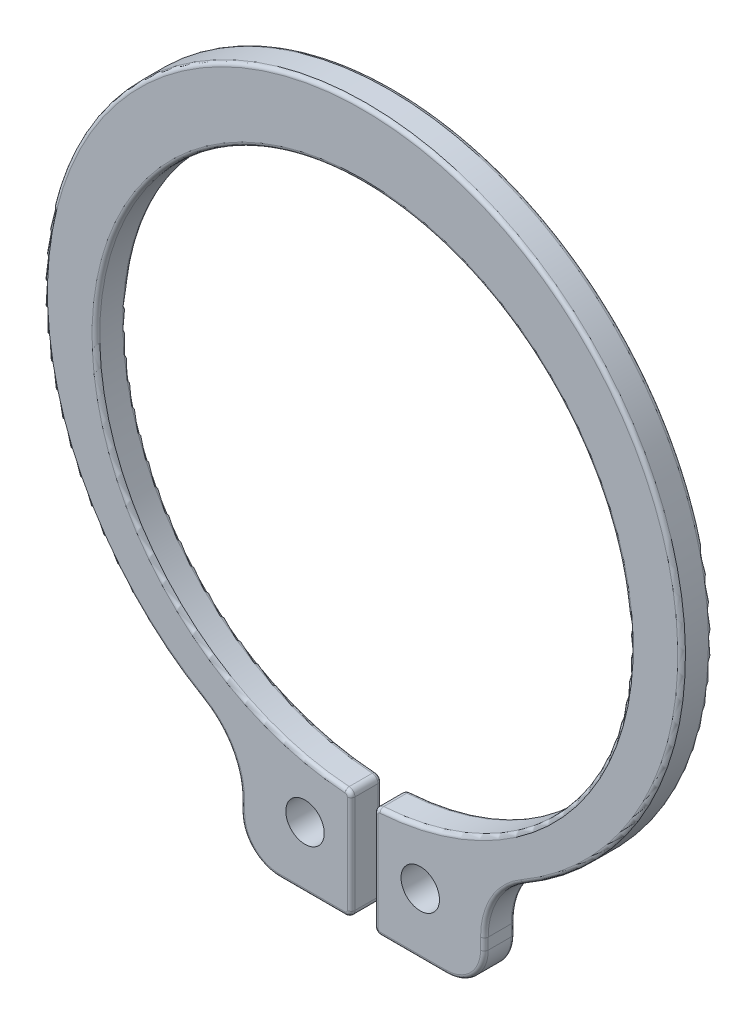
ISO-10303-21;
HEADER;
FILE_DESCRIPTION(('STEP AP214'),'2;1');
FILE_NAME('part.step','',(''),(''),'','','');
FILE_SCHEMA(('AUTOMOTIVE_DESIGN { 1 0 10303 214 1 1 1 1 }'));
ENDSEC;
DATA;
#1=APPLICATION_CONTEXT('core data for automotive mechanical design processes');
#2=APPLICATION_PROTOCOL_DEFINITION('international standard','automotive_design',2000,#1);
#3=PRODUCT_CONTEXT('',#1,'mechanical');
#4=PRODUCT('Part','Part','',(#3));
#5=PRODUCT_RELATED_PRODUCT_CATEGORY('part','',(#4));
#6=PRODUCT_DEFINITION_FORMATION('','',#4);
#7=PRODUCT_DEFINITION_CONTEXT('part definition',#1,'design');
#8=PRODUCT_DEFINITION('design','',#6,#7);
#9=PRODUCT_DEFINITION_SHAPE('','',#8);
#10=(LENGTH_UNIT() NAMED_UNIT(*) SI_UNIT(.MILLI.,.METRE.));
#11=(NAMED_UNIT(*) PLANE_ANGLE_UNIT() SI_UNIT($,.RADIAN.));
#12=(NAMED_UNIT(*) SI_UNIT($,.STERADIAN.) SOLID_ANGLE_UNIT());
#13=UNCERTAINTY_MEASURE_WITH_UNIT(LENGTH_MEASURE(1.E-05),#10,'distance_accuracy_value','');
#14=(GEOMETRIC_REPRESENTATION_CONTEXT(3) GLOBAL_UNCERTAINTY_ASSIGNED_CONTEXT((#13)) GLOBAL_UNIT_ASSIGNED_CONTEXT((#10,
#11,#12)) REPRESENTATION_CONTEXT('',''));
#15=CARTESIAN_POINT('',(0.,0.,0.));
#16=DIRECTION('',(0.,0.,1.));
#17=DIRECTION('',(1.,0.,0.));
#18=AXIS2_PLACEMENT_3D('',#15,#16,#17);
#19=CARTESIAN_POINT('',(0.584200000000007,-9.0044186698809,20.1930000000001));
#20=DIRECTION('',(-1.68935792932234E-13,0.,-1.));
#21=DIRECTION('',(-1.,0.,1.68935792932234E-13));
#22=AXIS2_PLACEMENT_3D('',#19,#20,#21);
#23=CYLINDRICAL_SURFACE('',#22,0.203199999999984);
#24=CARTESIAN_POINT('',(0.584200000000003,-9.0044186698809,20.193));
#25=DIRECTION('',(0.,0.,1.));
#26=DIRECTION('',(-0.0243225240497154,0.999704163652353,0.));
#27=AXIS2_PLACEMENT_3D('',#24,#25,#26);
#28=CIRCLE('',#27,0.203200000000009);
#29=CARTESIAN_POINT('',(0.571044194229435,-8.80164499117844,20.193));
#30=VERTEX_POINT('',#29);
#31=CARTESIAN_POINT('',(0.380999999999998,-9.0044186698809,20.193));
#32=VERTEX_POINT('',#31);
#33=EDGE_CURVE('E210',#30,#32,#28,.T.);
#34=ORIENTED_EDGE('',*,*,#33,.F.);
#35=DIRECTION('',(0.,0.,1.));
#36=VECTOR('',#35,1.);
#37=CARTESIAN_POINT('',(0.571044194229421,-8.80164499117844,19.812));
#38=LINE('',#37,#36);
#39=CARTESIAN_POINT('',(0.571044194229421,-8.80164499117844,19.431));
#40=VERTEX_POINT('',#39);
#41=EDGE_CURVE('E291',#40,#30,#38,.T.);
#42=ORIENTED_EDGE('',*,*,#41,.F.);
#43=CARTESIAN_POINT('',(0.584200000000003,-9.0044186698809,19.431));
#44=DIRECTION('',(0.,0.,-1.));
#45=DIRECTION('',(-1.,0.,0.));
#46=AXIS2_PLACEMENT_3D('',#43,#44,#45);
#47=CIRCLE('',#46,0.203200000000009);
#48=CARTESIAN_POINT('',(0.380999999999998,-9.0044186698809,19.431));
#49=VERTEX_POINT('',#48);
#50=EDGE_CURVE('E430',#49,#40,#47,.T.);
#51=ORIENTED_EDGE('',*,*,#50,.F.);
#52=DIRECTION('',(0.,0.,-1.));
#53=VECTOR('',#52,1.);
#54=CARTESIAN_POINT('',(0.380999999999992,-9.0044186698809,19.812));
#55=LINE('',#54,#53);
#56=EDGE_CURVE('E410',#32,#49,#55,.T.);
#57=ORIENTED_EDGE('',*,*,#56,.F.);
#58=EDGE_LOOP('',(#34,#42,#51,#57));
#59=FACE_BOUND('',#58,.T.);
#60=ADVANCED_FACE('F17',(#59),#23,.T.);
#61=CARTESIAN_POINT('',(0.,0.,20.1930000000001));
#62=DIRECTION('',(0.,0.,-1.));
#63=DIRECTION('',(-1.,0.,0.));
#64=AXIS2_PLACEMENT_3D('',#61,#62,#63);
#65=CYLINDRICAL_SURFACE('',#64,8.82015);
#66=CARTESIAN_POINT('',(0.,0.,19.431));
#67=DIRECTION('',(0.,0.,-1.));
#68=DIRECTION('',(-1.,0.,0.));
#69=AXIS2_PLACEMENT_3D('',#66,#67,#68);
#70=CIRCLE('',#69,8.82015);
#71=CARTESIAN_POINT('',(-0.571044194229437,-8.80164499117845,19.431));
#72=VERTEX_POINT('',#71);
#73=EDGE_CURVE('E193',#40,#72,#70,.F.);
#74=ORIENTED_EDGE('',*,*,#73,.F.);
#75=ORIENTED_EDGE('',*,*,#41,.T.);
#76=CARTESIAN_POINT('',(0.,0.,20.193));
#77=DIRECTION('',(0.,0.,-1.));
#78=DIRECTION('',(-1.,0.,0.));
#79=AXIS2_PLACEMENT_3D('',#76,#77,#78);
#80=CIRCLE('',#79,8.82015);
#81=CARTESIAN_POINT('',(-0.57104419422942,-8.80164499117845,20.193));
#82=VERTEX_POINT('',#81);
#83=EDGE_CURVE('E203',#82,#30,#80,.T.);
#84=ORIENTED_EDGE('',*,*,#83,.F.);
#85=DIRECTION('',(0.,0.,1.));
#86=VECTOR('',#85,1.);
#87=CARTESIAN_POINT('',(-0.571044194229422,-8.80164499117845,19.812));
#88=LINE('',#87,#86);
#89=EDGE_CURVE('E294',#72,#82,#88,.T.);
#90=ORIENTED_EDGE('',*,*,#89,.F.);
#91=EDGE_LOOP('',(#74,#75,#84,#90));
#92=FACE_BOUND('',#91,.T.);
#93=ADVANCED_FACE('F698',(#92),#65,.F.);
#94=CARTESIAN_POINT('',(-0.584200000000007,-9.0044186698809,19.431));
#95=DIRECTION('',(0.,0.,1.));
#96=DIRECTION('',(1.,0.,0.));
#97=AXIS2_PLACEMENT_3D('',#94,#95,#96);
#98=CYLINDRICAL_SURFACE('',#97,0.203199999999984);
#99=CARTESIAN_POINT('',(-0.584200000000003,-9.0044186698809,20.193));
#100=DIRECTION('',(0.,0.,1.));
#101=DIRECTION('',(1.,0.,0.));
#102=AXIS2_PLACEMENT_3D('',#99,#100,#101);
#103=CIRCLE('',#102,0.203200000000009);
#104=CARTESIAN_POINT('',(-0.380999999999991,-9.0044186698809,20.193));
#105=VERTEX_POINT('',#104);
#106=EDGE_CURVE('E287',#105,#82,#103,.T.);
#107=ORIENTED_EDGE('',*,*,#106,.F.);
#108=DIRECTION('',(0.,0.,1.));
#109=VECTOR('',#108,1.);
#110=CARTESIAN_POINT('',(-0.380999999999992,-9.0044186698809,19.812));
#111=LINE('',#110,#109);
#112=CARTESIAN_POINT('',(-0.380999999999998,-9.0044186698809,19.431));
#113=VERTEX_POINT('',#112);
#114=EDGE_CURVE('E297',#113,#105,#111,.T.);
#115=ORIENTED_EDGE('',*,*,#114,.F.);
#116=CARTESIAN_POINT('',(-0.584200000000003,-9.0044186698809,19.431));
#117=DIRECTION('',(0.,0.,-1.));
#118=DIRECTION('',(0.0243225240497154,0.999704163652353,0.));
#119=AXIS2_PLACEMENT_3D('',#116,#117,#118);
#120=CIRCLE('',#119,0.203200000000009);
#121=EDGE_CURVE('E300',#72,#113,#120,.T.);
#122=ORIENTED_EDGE('',*,*,#121,.F.);
#123=ORIENTED_EDGE('',*,*,#89,.T.);
#124=EDGE_LOOP('',(#107,#115,#122,#123));
#125=FACE_BOUND('',#124,.T.);
#126=ADVANCED_FACE('F767',(#125),#98,.T.);
#127=CARTESIAN_POINT('',(-0.380999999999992,-12.2536172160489,20.193));
#128=DIRECTION('',(1.,0.,0.));
#129=DIRECTION('',(0.,0.,-1.));
#130=AXIS2_PLACEMENT_3D('',#127,#128,#129);
#131=PLANE('',#130);
#132=ORIENTED_EDGE('',*,*,#114,.T.);
#133=DIRECTION('',(0.,1.,0.));
#134=VECTOR('',#133,1.);
#135=CARTESIAN_POINT('',(-0.380999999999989,-10.6290179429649,20.193));
#136=LINE('',#135,#134);
#137=CARTESIAN_POINT('',(-0.380999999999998,-12.2536172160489,20.193));
#138=VERTEX_POINT('',#137);
#139=EDGE_CURVE('E281',#138,#105,#136,.T.);
#140=ORIENTED_EDGE('',*,*,#139,.F.);
#141=DIRECTION('',(0.,0.,1.));
#142=VECTOR('',#141,1.);
#143=CARTESIAN_POINT('',(-0.380999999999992,-12.2536172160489,19.812));
#144=LINE('',#143,#142);
#145=CARTESIAN_POINT('',(-0.380999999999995,-12.2536172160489,19.431));
#146=VERTEX_POINT('',#145);
#147=EDGE_CURVE('E308',#146,#138,#144,.T.);
#148=ORIENTED_EDGE('',*,*,#147,.F.);
#149=DIRECTION('',(0.,-1.,0.));
#150=VECTOR('',#149,1.);
#151=CARTESIAN_POINT('',(-0.380999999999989,-10.6290179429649,19.431));
#152=LINE('',#151,#150);
#153=EDGE_CURVE('E311',#113,#146,#152,.T.);
#154=ORIENTED_EDGE('',*,*,#153,.F.);
#155=EDGE_LOOP('',(#132,#140,#148,#154));
#156=FACE_BOUND('',#155,.T.);
#157=ADVANCED_FACE('F760',(#156),#131,.T.);
#158=CARTESIAN_POINT('',(-0.584199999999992,-12.2536172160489,19.431));
#159=DIRECTION('',(0.,0.,1.));
#160=DIRECTION('',(1.,0.,0.));
#161=AXIS2_PLACEMENT_3D('',#158,#159,#160);
#162=CYLINDRICAL_SURFACE('',#161,0.203199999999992);
#163=CARTESIAN_POINT('',(-0.584199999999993,-12.2536172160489,20.1930000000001));
#164=DIRECTION('',(1.19518349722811E-13,1.19518349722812E-13,1.));
#165=DIRECTION('',(1.,0.,-1.19518349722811E-13));
#166=AXIS2_PLACEMENT_3D('',#163,#164,#165);
#167=CIRCLE('',#166,0.2032);
#168=CARTESIAN_POINT('',(-0.584199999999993,-12.456817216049,20.193));
#169=VERTEX_POINT('',#168);
#170=EDGE_CURVE('E275',#169,#138,#167,.T.);
#171=ORIENTED_EDGE('',*,*,#170,.F.);
#172=DIRECTION('',(0.,0.,1.));
#173=VECTOR('',#172,1.);
#174=CARTESIAN_POINT('',(-0.584199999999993,-12.4568172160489,19.812));
#175=LINE('',#174,#173);
#176=CARTESIAN_POINT('',(-0.584199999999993,-12.4568172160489,19.431));
#177=VERTEX_POINT('',#176);
#178=EDGE_CURVE('E319',#177,#169,#175,.T.);
#179=ORIENTED_EDGE('',*,*,#178,.F.);
#180=CARTESIAN_POINT('',(-0.584199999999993,-12.2536172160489,19.431));
#181=DIRECTION('',(0.,0.,-1.));
#182=DIRECTION('',(-1.,0.,0.));
#183=AXIS2_PLACEMENT_3D('',#180,#181,#182);
#184=CIRCLE('',#183,0.203199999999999);
#185=EDGE_CURVE('E322',#146,#177,#184,.T.);
#186=ORIENTED_EDGE('',*,*,#185,.F.);
#187=ORIENTED_EDGE('',*,*,#147,.T.);
#188=EDGE_LOOP('',(#171,#179,#186,#187));
#189=FACE_BOUND('',#188,.T.);
#190=ADVANCED_FACE('F757',(#189),#162,.T.);
#191=CARTESIAN_POINT('',(-2.7559,-12.4568172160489,20.193));
#192=DIRECTION('',(0.,-1.,0.));
#193=DIRECTION('',(0.,0.,-1.));
#194=AXIS2_PLACEMENT_3D('',#191,#192,#193);
#195=PLANE('',#194);
#196=DIRECTION('',(1.,0.,0.));
#197=VECTOR('',#196,1.);
#198=CARTESIAN_POINT('',(-1.67005,-12.4568172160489,20.193));
#199=LINE('',#198,#197);
#200=CARTESIAN_POINT('',(-2.7559,-12.4568172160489,20.193));
#201=VERTEX_POINT('',#200);
#202=EDGE_CURVE('E269',#201,#169,#199,.T.);
#203=ORIENTED_EDGE('',*,*,#202,.F.);
#204=DIRECTION('',(0.,0.,1.));
#205=VECTOR('',#204,1.);
#206=CARTESIAN_POINT('',(-2.75590000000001,-12.456817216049,19.812));
#207=LINE('',#206,#205);
#208=CARTESIAN_POINT('',(-2.7559,-12.4568172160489,19.431));
#209=VERTEX_POINT('',#208);
#210=EDGE_CURVE('E330',#209,#201,#207,.T.);
#211=ORIENTED_EDGE('',*,*,#210,.F.);
#212=DIRECTION('',(-1.,0.,0.));
#213=VECTOR('',#212,1.);
#214=CARTESIAN_POINT('',(-1.67005,-12.456817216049,19.431));
#215=LINE('',#214,#213);
#216=EDGE_CURVE('E333',#177,#209,#215,.T.);
#217=ORIENTED_EDGE('',*,*,#216,.F.);
#218=ORIENTED_EDGE('',*,*,#178,.T.);
#219=EDGE_LOOP('',(#203,#211,#217,#218));
#220=FACE_BOUND('',#219,.T.);
#221=ADVANCED_FACE('F744',(#220),#195,.T.);
#222=CARTESIAN_POINT('',(-2.75590000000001,-11.186817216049,19.431));
#223=DIRECTION('',(0.,0.,1.));
#224=DIRECTION('',(1.,0.,0.));
#225=AXIS2_PLACEMENT_3D('',#222,#223,#224);
#226=CYLINDRICAL_SURFACE('',#225,1.27);
#227=CARTESIAN_POINT('',(-2.7559,-11.1868172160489,20.1930000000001));
#228=DIRECTION('',(0.,0.,1.));
#229=DIRECTION('',(1.,0.,0.));
#230=AXIS2_PLACEMENT_3D('',#227,#228,#229);
#231=CIRCLE('',#230,1.27);
#232=CARTESIAN_POINT('',(-4.0259,-11.1868172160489,20.193));
#233=VERTEX_POINT('',#232);
#234=EDGE_CURVE('E263',#233,#201,#231,.T.);
#235=ORIENTED_EDGE('',*,*,#234,.F.);
#236=DIRECTION('',(0.,0.,1.));
#237=VECTOR('',#236,1.);
#238=CARTESIAN_POINT('',(-4.0259,-11.1868172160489,19.812));
#239=LINE('',#238,#237);
#240=CARTESIAN_POINT('',(-4.02590000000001,-11.1868172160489,19.431));
#241=VERTEX_POINT('',#240);
#242=EDGE_CURVE('E341',#241,#233,#239,.T.);
#243=ORIENTED_EDGE('',*,*,#242,.F.);
#244=CARTESIAN_POINT('',(-2.7559,-11.1868172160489,19.431));
#245=DIRECTION('',(0.,0.,-1.));
#246=DIRECTION('',(-1.,0.,0.));
#247=AXIS2_PLACEMENT_3D('',#244,#245,#246);
#248=CIRCLE('',#247,1.27);
#249=EDGE_CURVE('E344',#209,#241,#248,.T.);
#250=ORIENTED_EDGE('',*,*,#249,.F.);
#251=ORIENTED_EDGE('',*,*,#210,.T.);
#252=EDGE_LOOP('',(#235,#243,#250,#251));
#253=FACE_BOUND('',#252,.T.);
#254=ADVANCED_FACE('F748',(#253),#226,.T.);
#255=CARTESIAN_POINT('',(-4.0259,-11.1868172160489,19.431));
#256=DIRECTION('',(-1.,0.,0.));
#257=DIRECTION('',(0.,0.,1.));
#258=AXIS2_PLACEMENT_3D('',#255,#256,#257);
#259=PLANE('',#258);
#260=DIRECTION('',(0.,-1.,0.));
#261=VECTOR('',#260,1.);
#262=CARTESIAN_POINT('',(-4.02590000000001,-10.9999670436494,20.193));
#263=LINE('',#262,#261);
#264=CARTESIAN_POINT('',(-4.0259,-10.8131168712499,20.193));
#265=VERTEX_POINT('',#264);
#266=EDGE_CURVE('E257',#265,#233,#263,.T.);
#267=ORIENTED_EDGE('',*,*,#266,.F.);
#268=DIRECTION('',(0.,0.,1.));
#269=VECTOR('',#268,1.);
#270=CARTESIAN_POINT('',(-4.02589999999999,-10.8131168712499,19.812));
#271=LINE('',#270,#269);
#272=CARTESIAN_POINT('',(-4.0259,-10.8131168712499,19.431));
#273=VERTEX_POINT('',#272);
#274=EDGE_CURVE('E352',#273,#265,#271,.T.);
#275=ORIENTED_EDGE('',*,*,#274,.F.);
#276=DIRECTION('',(0.,1.,0.));
#277=VECTOR('',#276,1.);
#278=CARTESIAN_POINT('',(-4.02590000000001,-10.9999670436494,19.431));
#279=LINE('',#278,#277);
#280=EDGE_CURVE('E355',#241,#273,#279,.T.);
#281=ORIENTED_EDGE('',*,*,#280,.F.);
#282=ORIENTED_EDGE('',*,*,#242,.T.);
#283=EDGE_LOOP('',(#267,#275,#281,#282));
#284=FACE_BOUND('',#283,.T.);
#285=ADVANCED_FACE('F1179',(#284),#259,.T.);
#286=CARTESIAN_POINT('',(-6.56589999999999,-10.8131168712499,19.431));
#287=DIRECTION('',(0.,0.,1.));
#288=DIRECTION('',(1.,0.,0.));
#289=AXIS2_PLACEMENT_3D('',#286,#287,#288);
#290=CYLINDRICAL_SURFACE('',#289,2.54000000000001);
#291=CARTESIAN_POINT('',(-6.56590000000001,-10.8131168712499,20.193));
#292=DIRECTION('',(0.,0.,-1.));
#293=DIRECTION('',(0.483498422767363,0.875345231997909,0.));
#294=AXIS2_PLACEMENT_3D('',#291,#292,#293);
#295=CIRCLE('',#294,2.54);
#296=CARTESIAN_POINT('',(-5.29158655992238,-8.61590835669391,20.193));
#297=VERTEX_POINT('',#296);
#298=EDGE_CURVE('E251',#297,#265,#295,.T.);
#299=ORIENTED_EDGE('',*,*,#298,.F.);
#300=DIRECTION('',(0.,0.,1.));
#301=VECTOR('',#300,1.);
#302=CARTESIAN_POINT('',(-5.29158655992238,-8.61590835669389,19.812));
#303=LINE('',#302,#301);
#304=CARTESIAN_POINT('',(-5.29158655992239,-8.6159083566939,19.431));
#305=VERTEX_POINT('',#304);
#306=EDGE_CURVE('E363',#305,#297,#303,.T.);
#307=ORIENTED_EDGE('',*,*,#306,.F.);
#308=CARTESIAN_POINT('',(-6.56590000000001,-10.8131168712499,19.431));
#309=DIRECTION('',(0.,0.,1.));
#310=DIRECTION('',(1.,0.,0.));
#311=AXIS2_PLACEMENT_3D('',#308,#309,#310);
#312=CIRCLE('',#311,2.54);
#313=EDGE_CURVE('E366',#273,#305,#312,.T.);
#314=ORIENTED_EDGE('',*,*,#313,.F.);
#315=ORIENTED_EDGE('',*,*,#274,.T.);
#316=EDGE_LOOP('',(#299,#307,#314,#315));
#317=FACE_BOUND('',#316,.T.);
#318=ADVANCED_FACE('F1170',(#317),#290,.F.);
#319=CARTESIAN_POINT('',(0.,0.50800000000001,20.1930000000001));
#320=DIRECTION('',(0.,0.,-1.));
#321=DIRECTION('',(-1.,0.,0.));
#322=AXIS2_PLACEMENT_3D('',#319,#320,#321);
#323=CYLINDRICAL_SURFACE('',#322,10.54735);
#324=ORIENTED_EDGE('',*,*,#306,.T.);
#325=CARTESIAN_POINT('',(0.,0.508000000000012,20.1930000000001));
#326=DIRECTION('',(0.,0.,-1.));
#327=DIRECTION('',(-1.,0.,0.));
#328=AXIS2_PLACEMENT_3D('',#325,#326,#327);
#329=CIRCLE('',#328,10.54735);
#330=CARTESIAN_POINT('',(5.29158655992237,-8.61590835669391,20.1930000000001));
#331=VERTEX_POINT('',#330);
#332=EDGE_CURVE('E198',#331,#297,#329,.F.);
#333=ORIENTED_EDGE('',*,*,#332,.F.);
#334=DIRECTION('',(0.,0.,1.));
#335=VECTOR('',#334,1.);
#336=CARTESIAN_POINT('',(5.29158655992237,-8.6159083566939,19.812));
#337=LINE('',#336,#335);
#338=CARTESIAN_POINT('',(5.29158655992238,-8.61590835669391,19.431));
#339=VERTEX_POINT('',#338);
#340=EDGE_CURVE('E371',#339,#331,#337,.T.);
#341=ORIENTED_EDGE('',*,*,#340,.F.);
#342=CARTESIAN_POINT('',(0.,0.508000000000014,19.431));
#343=DIRECTION('',(0.,0.,-1.));
#344=DIRECTION('',(-1.,0.,0.));
#345=AXIS2_PLACEMENT_3D('',#342,#343,#344);
#346=CIRCLE('',#345,10.54735);
#347=EDGE_CURVE('E188',#305,#339,#346,.T.);
#348=ORIENTED_EDGE('',*,*,#347,.F.);
#349=EDGE_LOOP('',(#324,#333,#341,#348));
#350=FACE_BOUND('',#349,.T.);
#351=ADVANCED_FACE('F1161',(#350),#323,.T.);
#352=CARTESIAN_POINT('',(6.56589999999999,-10.8131168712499,20.1930000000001));
#353=DIRECTION('',(0.,0.,-1.));
#354=DIRECTION('',(0.,1.,0.));
#355=AXIS2_PLACEMENT_3D('',#352,#353,#354);
#356=CYLINDRICAL_SURFACE('',#355,2.54000000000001);
#357=CARTESIAN_POINT('',(6.56590000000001,-10.8131168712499,20.193));
#358=DIRECTION('',(0.,0.,-1.));
#359=DIRECTION('',(-1.,0.,0.));
#360=AXIS2_PLACEMENT_3D('',#357,#358,#359);
#361=CIRCLE('',#360,2.54);
#362=CARTESIAN_POINT('',(4.02590000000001,-10.8131168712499,20.193));
#363=VERTEX_POINT('',#362);
#364=EDGE_CURVE('E246',#363,#331,#361,.T.);
#365=ORIENTED_EDGE('',*,*,#364,.F.);
#366=DIRECTION('',(0.,0.,1.));
#367=VECTOR('',#366,1.);
#368=CARTESIAN_POINT('',(4.0259,-10.8131168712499,19.812));
#369=LINE('',#368,#367);
#370=CARTESIAN_POINT('',(4.02590000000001,-10.8131168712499,19.431));
#371=VERTEX_POINT('',#370);
#372=EDGE_CURVE('E374',#371,#363,#369,.T.);
#373=ORIENTED_EDGE('',*,*,#372,.F.);
#374=CARTESIAN_POINT('',(6.56590000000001,-10.8131168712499,19.431));
#375=DIRECTION('',(0.,0.,1.));
#376=DIRECTION('',(-0.483498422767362,0.875345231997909,0.));
#377=AXIS2_PLACEMENT_3D('',#374,#375,#376);
#378=CIRCLE('',#377,2.54);
#379=EDGE_CURVE('E377',#339,#371,#378,.T.);
#380=ORIENTED_EDGE('',*,*,#379,.F.);
#381=ORIENTED_EDGE('',*,*,#340,.T.);
#382=EDGE_LOOP('',(#365,#373,#380,#381));
#383=FACE_BOUND('',#382,.T.);
#384=ADVANCED_FACE('F1152',(#383),#356,.F.);
#385=CARTESIAN_POINT('',(4.0259,-11.1868172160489,20.193));
#386=DIRECTION('',(1.,0.,0.));
#387=DIRECTION('',(0.,0.,-1.));
#388=AXIS2_PLACEMENT_3D('',#385,#386,#387);
#389=PLANE('',#388);
#390=DIRECTION('',(0.,1.,0.));
#391=VECTOR('',#390,1.);
#392=CARTESIAN_POINT('',(4.02590000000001,-10.9999670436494,20.193));
#393=LINE('',#392,#391);
#394=CARTESIAN_POINT('',(4.0259,-11.1868172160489,20.193));
#395=VERTEX_POINT('',#394);
#396=EDGE_CURVE('E240',#395,#363,#393,.T.);
#397=ORIENTED_EDGE('',*,*,#396,.F.);
#398=DIRECTION('',(0.,0.,1.));
#399=VECTOR('',#398,1.);
#400=CARTESIAN_POINT('',(4.02590000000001,-11.1868172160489,19.812));
#401=LINE('',#400,#399);
#402=CARTESIAN_POINT('',(4.02590000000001,-11.1868172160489,19.431));
#403=VERTEX_POINT('',#402);
#404=EDGE_CURVE('E385',#403,#395,#401,.T.);
#405=ORIENTED_EDGE('',*,*,#404,.F.);
#406=DIRECTION('',(0.,-1.,0.));
#407=VECTOR('',#406,1.);
#408=CARTESIAN_POINT('',(4.02590000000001,-10.9999670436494,19.431));
#409=LINE('',#408,#407);
#410=EDGE_CURVE('E388',#371,#403,#409,.T.);
#411=ORIENTED_EDGE('',*,*,#410,.F.);
#412=ORIENTED_EDGE('',*,*,#372,.T.);
#413=EDGE_LOOP('',(#397,#405,#411,#412));
#414=FACE_BOUND('',#413,.T.);
#415=ADVANCED_FACE('F1143',(#414),#389,.T.);
#416=CARTESIAN_POINT('',(2.75590000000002,-11.186817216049,19.431));
#417=DIRECTION('',(0.,0.,1.));
#418=DIRECTION('',(1.,0.,0.));
#419=AXIS2_PLACEMENT_3D('',#416,#417,#418);
#420=CYLINDRICAL_SURFACE('',#419,1.27000000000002);
#421=CARTESIAN_POINT('',(2.7559,-11.1868172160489,20.1930000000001));
#422=DIRECTION('',(0.,0.,1.));
#423=DIRECTION('',(1.,0.,0.));
#424=AXIS2_PLACEMENT_3D('',#421,#422,#423);
#425=CIRCLE('',#424,1.27);
#426=CARTESIAN_POINT('',(2.7559,-12.4568172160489,20.193));
#427=VERTEX_POINT('',#426);
#428=EDGE_CURVE('E234',#427,#395,#425,.T.);
#429=ORIENTED_EDGE('',*,*,#428,.F.);
#430=DIRECTION('',(0.,0.,1.));
#431=VECTOR('',#430,1.);
#432=CARTESIAN_POINT('',(2.7559,-12.4568172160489,19.812));
#433=LINE('',#432,#431);
#434=CARTESIAN_POINT('',(2.7559,-12.4568172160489,19.431));
#435=VERTEX_POINT('',#434);
#436=EDGE_CURVE('E394',#435,#427,#433,.T.);
#437=ORIENTED_EDGE('',*,*,#436,.F.);
#438=CARTESIAN_POINT('',(2.7559,-11.1868172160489,19.431));
#439=DIRECTION('',(0.,0.,-1.));
#440=DIRECTION('',(-1.,0.,0.));
#441=AXIS2_PLACEMENT_3D('',#438,#439,#440);
#442=CIRCLE('',#441,1.27);
#443=EDGE_CURVE('E96',#403,#435,#442,.T.);
#444=ORIENTED_EDGE('',*,*,#443,.F.);
#445=ORIENTED_EDGE('',*,*,#404,.T.);
#446=EDGE_LOOP('',(#429,#437,#444,#445));
#447=FACE_BOUND('',#446,.T.);
#448=ADVANCED_FACE('F1134',(#447),#420,.T.);
#449=CARTESIAN_POINT('',(0.584199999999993,-12.4568172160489,20.193));
#450=DIRECTION('',(0.,-1.,0.));
#451=DIRECTION('',(0.,0.,-1.));
#452=AXIS2_PLACEMENT_3D('',#449,#450,#451);
#453=PLANE('',#452);
#454=DIRECTION('',(1.,0.,0.));
#455=VECTOR('',#454,1.);
#456=CARTESIAN_POINT('',(1.67005,-12.456817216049,20.193));
#457=LINE('',#456,#455);
#458=CARTESIAN_POINT('',(0.584199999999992,-12.4568172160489,20.193));
#459=VERTEX_POINT('',#458);
#460=EDGE_CURVE('E228',#459,#427,#457,.T.);
#461=ORIENTED_EDGE('',*,*,#460,.F.);
#462=DIRECTION('',(0.,0.,1.));
#463=VECTOR('',#462,1.);
#464=CARTESIAN_POINT('',(0.584199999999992,-12.456817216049,19.812));
#465=LINE('',#464,#463);
#466=CARTESIAN_POINT('',(0.584199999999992,-12.4568172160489,19.431));
#467=VERTEX_POINT('',#466);
#468=EDGE_CURVE('E402',#467,#459,#465,.T.);
#469=ORIENTED_EDGE('',*,*,#468,.F.);
#470=DIRECTION('',(-1.,0.,0.));
#471=VECTOR('',#470,1.);
#472=CARTESIAN_POINT('',(1.67005,-12.456817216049,19.431));
#473=LINE('',#472,#471);
#474=EDGE_CURVE('E100',#435,#467,#473,.T.);
#475=ORIENTED_EDGE('',*,*,#474,.F.);
#476=ORIENTED_EDGE('',*,*,#436,.T.);
#477=EDGE_LOOP('',(#461,#469,#475,#476));
#478=FACE_BOUND('',#477,.T.);
#479=ADVANCED_FACE('F1126',(#478),#453,.T.);
#480=CARTESIAN_POINT('',(0.584199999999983,-12.253617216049,19.431));
#481=DIRECTION('',(0.,0.,1.));
#482=DIRECTION('',(1.,0.,0.));
#483=AXIS2_PLACEMENT_3D('',#480,#481,#482);
#484=CYLINDRICAL_SURFACE('',#483,0.203200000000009);
#485=CARTESIAN_POINT('',(0.584199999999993,-12.2536172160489,20.1930000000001));
#486=DIRECTION('',(1.19518349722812E-13,1.19518349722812E-13,1.));
#487=DIRECTION('',(1.,0.,-1.19518349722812E-13));
#488=AXIS2_PLACEMENT_3D('',#485,#486,#487);
#489=CIRCLE('',#488,0.203199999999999);
#490=CARTESIAN_POINT('',(0.380999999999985,-12.2536172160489,20.193));
#491=VERTEX_POINT('',#490);
#492=EDGE_CURVE('E222',#491,#459,#489,.T.);
#493=ORIENTED_EDGE('',*,*,#492,.F.);
#494=DIRECTION('',(0.,0.,1.));
#495=VECTOR('',#494,1.);
#496=CARTESIAN_POINT('',(0.380999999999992,-12.2536172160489,19.812));
#497=LINE('',#496,#495);
#498=CARTESIAN_POINT('',(0.380999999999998,-12.2536172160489,19.431));
#499=VERTEX_POINT('',#498);
#500=EDGE_CURVE('E207',#499,#491,#497,.T.);
#501=ORIENTED_EDGE('',*,*,#500,.F.);
#502=CARTESIAN_POINT('',(0.584199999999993,-12.2536172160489,19.431));
#503=DIRECTION('',(0.,0.,-1.));
#504=DIRECTION('',(-1.,0.,0.));
#505=AXIS2_PLACEMENT_3D('',#502,#503,#504);
#506=CIRCLE('',#505,0.2032);
#507=EDGE_CURVE('E413',#467,#499,#506,.T.);
#508=ORIENTED_EDGE('',*,*,#507,.F.);
#509=ORIENTED_EDGE('',*,*,#468,.T.);
#510=EDGE_LOOP('',(#493,#501,#508,#509));
#511=FACE_BOUND('',#510,.T.);
#512=ADVANCED_FACE('F1118',(#511),#484,.T.);
#513=CARTESIAN_POINT('',(0.380999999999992,-12.2536172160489,19.431));
#514=DIRECTION('',(-1.,0.,0.));
#515=DIRECTION('',(0.,0.,1.));
#516=AXIS2_PLACEMENT_3D('',#513,#514,#515);
#517=PLANE('',#516);
#518=ORIENTED_EDGE('',*,*,#500,.T.);
#519=DIRECTION('',(0.,-1.,0.));
#520=VECTOR('',#519,1.);
#521=CARTESIAN_POINT('',(0.38099999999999,-10.6290179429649,20.193));
#522=LINE('',#521,#520);
#523=EDGE_CURVE('E216',#32,#491,#522,.T.);
#524=ORIENTED_EDGE('',*,*,#523,.F.);
#525=ORIENTED_EDGE('',*,*,#56,.T.);
#526=DIRECTION('',(0.,1.,0.));
#527=VECTOR('',#526,1.);
#528=CARTESIAN_POINT('',(0.38099999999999,-10.6290179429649,19.431));
#529=LINE('',#528,#527);
#530=EDGE_CURVE('E425',#499,#49,#529,.T.);
#531=ORIENTED_EDGE('',*,*,#530,.F.);
#532=EDGE_LOOP('',(#518,#524,#525,#531));
#533=FACE_BOUND('',#532,.T.);
#534=ADVANCED_FACE('F709',(#533),#517,.T.);
#535=CARTESIAN_POINT('',(0.,0.,20.193));
#536=DIRECTION('',(0.,0.,1.));
#537=DIRECTION('',(1.,0.,0.));
#538=AXIS2_PLACEMENT_3D('',#535,#536,#537);
#539=TOROIDAL_SURFACE('',#538,8.94715,0.127000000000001);
#540=CARTESIAN_POINT('',(-0.579266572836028,-8.9283785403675,20.193));
#541=DIRECTION('',(0.997901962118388,-0.0647431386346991,0.));
#542=DIRECTION('',(-0.0388458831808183,-0.598741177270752,0.80000000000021));
#543=AXIS2_PLACEMENT_3D('',#540,#541,#542);
#544=CIRCLE('',#543,0.127000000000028);
#545=CARTESIAN_POINT('',(-0.579266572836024,-8.92837854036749,20.32));
#546=VERTEX_POINT('',#545);
#547=EDGE_CURVE('E290',#82,#546,#544,.T.);
#548=ORIENTED_EDGE('',*,*,#547,.F.);
#549=ORIENTED_EDGE('',*,*,#83,.T.);
#550=CARTESIAN_POINT('',(0.579266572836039,-8.9283785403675,20.193));
#551=DIRECTION('',(-0.997901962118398,-0.0647431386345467,0.));
#552=DIRECTION('',(0.0388458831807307,-0.598741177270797,0.80000000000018));
#553=AXIS2_PLACEMENT_3D('',#550,#551,#552);
#554=CIRCLE('',#553,0.127000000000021);
#555=CARTESIAN_POINT('',(0.57926657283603,-8.92837854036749,20.32));
#556=VERTEX_POINT('',#555);
#557=EDGE_CURVE('E206',#556,#30,#554,.T.);
#558=ORIENTED_EDGE('',*,*,#557,.F.);
#559=CARTESIAN_POINT('',(0.,0.,20.32));
#560=DIRECTION('',(0.,0.,1.));
#561=DIRECTION('',(1.,0.,0.));
#562=AXIS2_PLACEMENT_3D('',#559,#560,#561);
#563=CIRCLE('',#562,8.94714999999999);
#564=EDGE_CURVE('E179',#546,#556,#563,.F.);
#565=ORIENTED_EDGE('',*,*,#564,.F.);
#566=EDGE_LOOP('',(#548,#549,#558,#565));
#567=FACE_BOUND('',#566,.T.);
#568=ADVANCED_FACE('F773',(#567),#539,.T.);
#569=CARTESIAN_POINT('',(0.584199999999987,-9.0044186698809,20.193));
#570=DIRECTION('',(0.,0.,1.));
#571=DIRECTION('',(1.,0.,0.));
#572=AXIS2_PLACEMENT_3D('',#569,#570,#571);
#573=DEGENERATE_TOROIDAL_SURFACE('',#572,0.0761999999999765,0.127000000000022,.T.);
#574=ORIENTED_EDGE('',*,*,#557,.T.);
#575=ORIENTED_EDGE('',*,*,#33,.T.);
#576=CARTESIAN_POINT('',(0.508000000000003,-9.0044186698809,20.193));
#577=DIRECTION('',(0.,-1.,0.));
#578=DIRECTION('',(0.707106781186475,0.,-0.70710678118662));
#579=AXIS2_PLACEMENT_3D('',#576,#577,#578);
#580=CIRCLE('',#579,0.126999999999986);
#581=CARTESIAN_POINT('',(0.508000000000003,-9.0044186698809,20.32));
#582=VERTEX_POINT('',#581);
#583=EDGE_CURVE('E213',#582,#32,#580,.T.);
#584=ORIENTED_EDGE('',*,*,#583,.F.);
#585=CARTESIAN_POINT('',(0.584199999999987,-9.0044186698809,20.32));
#586=DIRECTION('',(0.,0.,1.));
#587=DIRECTION('',(1.,0.,0.));
#588=AXIS2_PLACEMENT_3D('',#585,#586,#587);
#589=CIRCLE('',#588,0.0761999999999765);
#590=EDGE_CURVE('E176',#556,#582,#589,.T.);
#591=ORIENTED_EDGE('',*,*,#590,.F.);
#592=EDGE_LOOP('',(#574,#575,#584,#591));
#593=FACE_BOUND('',#592,.T.);
#594=ADVANCED_FACE('F775',(#593),#573,.T.);
#595=CARTESIAN_POINT('',(0.508000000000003,-12.2536172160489,20.193));
#596=DIRECTION('',(0.,1.,0.));
#597=DIRECTION('',(-1.,0.,0.));
#598=AXIS2_PLACEMENT_3D('',#595,#596,#597);
#599=CYLINDRICAL_SURFACE('',#598,0.126999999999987);
#600=ORIENTED_EDGE('',*,*,#583,.T.);
#601=ORIENTED_EDGE('',*,*,#523,.T.);
#602=CARTESIAN_POINT('',(0.507999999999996,-12.2536172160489,20.193));
#603=DIRECTION('',(0.,-1.,0.));
#604=DIRECTION('',(0.599999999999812,0.,0.800000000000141));
#605=AXIS2_PLACEMENT_3D('',#602,#603,#604);
#606=CIRCLE('',#605,0.127000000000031);
#607=CARTESIAN_POINT('',(0.507999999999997,-12.2536172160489,20.32));
#608=VERTEX_POINT('',#607);
#609=EDGE_CURVE('E219',#608,#491,#606,.T.);
#610=ORIENTED_EDGE('',*,*,#609,.F.);
#611=DIRECTION('',(0.,-1.,0.));
#612=VECTOR('',#611,1.);
#613=CARTESIAN_POINT('',(0.507999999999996,-0.70073360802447,20.32));
#614=LINE('',#613,#612);
#615=EDGE_CURVE('E175',#582,#608,#614,.T.);
#616=ORIENTED_EDGE('',*,*,#615,.F.);
#617=EDGE_LOOP('',(#600,#601,#610,#616));
#618=FACE_BOUND('',#617,.T.);
#619=ADVANCED_FACE('F778',(#618),#599,.T.);
#620=CARTESIAN_POINT('',(0.584199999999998,-12.2536172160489,20.193));
#621=DIRECTION('',(0.,0.,1.));
#622=DIRECTION('',(0.,-1.,0.));
#623=AXIS2_PLACEMENT_3D('',#620,#621,#622);
#624=DEGENERATE_TOROIDAL_SURFACE('',#623,0.076199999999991,0.127000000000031,.T.);
#625=ORIENTED_EDGE('',*,*,#609,.T.);
#626=ORIENTED_EDGE('',*,*,#492,.T.);
#627=CARTESIAN_POINT('',(0.584199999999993,-12.3298172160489,20.193));
#628=DIRECTION('',(1.,0.,0.));
#629=DIRECTION('',(0.,0.707106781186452,-0.707106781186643));
#630=AXIS2_PLACEMENT_3D('',#627,#628,#629);
#631=CIRCLE('',#630,0.126999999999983);
#632=CARTESIAN_POINT('',(0.584199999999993,-12.3298172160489,20.32));
#633=VERTEX_POINT('',#632);
#634=EDGE_CURVE('E225',#633,#459,#631,.T.);
#635=ORIENTED_EDGE('',*,*,#634,.F.);
#636=CARTESIAN_POINT('',(0.584199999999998,-12.2536172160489,20.32));
#637=DIRECTION('',(0.,0.,1.));
#638=DIRECTION('',(0.,-1.,0.));
#639=AXIS2_PLACEMENT_3D('',#636,#637,#638);
#640=CIRCLE('',#639,0.076199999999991);
#641=EDGE_CURVE('E172',#608,#633,#640,.T.);
#642=ORIENTED_EDGE('',*,*,#641,.F.);
#643=EDGE_LOOP('',(#625,#626,#635,#642));
#644=FACE_BOUND('',#643,.T.);
#645=ADVANCED_FACE('F782',(#644),#624,.T.);
#646=CARTESIAN_POINT('',(2.7559,-12.3298172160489,20.193));
#647=DIRECTION('',(-1.,0.,0.));
#648=DIRECTION('',(0.,0.,1.));
#649=AXIS2_PLACEMENT_3D('',#646,#647,#648);
#650=CYLINDRICAL_SURFACE('',#649,0.126999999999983);
#651=ORIENTED_EDGE('',*,*,#634,.T.);
#652=ORIENTED_EDGE('',*,*,#460,.T.);
#653=CARTESIAN_POINT('',(2.7559,-12.3298172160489,20.193));
#654=DIRECTION('',(1.,0.,0.));
#655=DIRECTION('',(0.,1.,0.));
#656=AXIS2_PLACEMENT_3D('',#653,#654,#655);
#657=CIRCLE('',#656,0.127000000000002);
#658=CARTESIAN_POINT('',(2.7559,-12.3298172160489,20.32));
#659=VERTEX_POINT('',#658);
#660=EDGE_CURVE('E231',#659,#427,#657,.T.);
#661=ORIENTED_EDGE('',*,*,#660,.F.);
#662=DIRECTION('',(1.,0.,0.));
#663=VECTOR('',#662,1.);
#664=CARTESIAN_POINT('',(0.,-12.3298172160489,20.32));
#665=LINE('',#664,#663);
#666=EDGE_CURVE('E171',#633,#659,#665,.T.);
#667=ORIENTED_EDGE('',*,*,#666,.F.);
#668=EDGE_LOOP('',(#651,#652,#661,#667));
#669=FACE_BOUND('',#668,.T.);
#670=ADVANCED_FACE('F785',(#669),#650,.T.);
#671=CARTESIAN_POINT('',(2.7559,-11.1868172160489,20.1930000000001));
#672=DIRECTION('',(0.,0.,1.));
#673=DIRECTION('',(0.,-1.,0.));
#674=AXIS2_PLACEMENT_3D('',#671,#672,#673);
#675=TOROIDAL_SURFACE('',#674,1.143,0.127000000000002);
#676=ORIENTED_EDGE('',*,*,#660,.T.);
#677=ORIENTED_EDGE('',*,*,#428,.T.);
#678=CARTESIAN_POINT('',(3.8989,-11.1868172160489,20.193));
#679=DIRECTION('',(0.,1.,0.));
#680=DIRECTION('',(-0.707106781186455,0.,-0.70710678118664));
#681=AXIS2_PLACEMENT_3D('',#678,#679,#680);
#682=CIRCLE('',#681,0.126999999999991);
#683=CARTESIAN_POINT('',(3.89890000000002,-11.1868172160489,20.32));
#684=VERTEX_POINT('',#683);
#685=EDGE_CURVE('E237',#684,#395,#682,.T.);
#686=ORIENTED_EDGE('',*,*,#685,.F.);
#687=CARTESIAN_POINT('',(2.7559,-11.1868172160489,20.32));
#688=DIRECTION('',(0.,0.,1.));
#689=DIRECTION('',(0.,-1.,0.));
#690=AXIS2_PLACEMENT_3D('',#687,#688,#689);
#691=CIRCLE('',#690,1.143);
#692=EDGE_CURVE('E168',#659,#684,#691,.T.);
#693=ORIENTED_EDGE('',*,*,#692,.F.);
#694=EDGE_LOOP('',(#676,#677,#686,#693));
#695=FACE_BOUND('',#694,.T.);
#696=ADVANCED_FACE('F789',(#695),#675,.T.);
#697=CARTESIAN_POINT('',(3.8989,-10.8131168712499,20.193));
#698=DIRECTION('',(0.,-1.,0.));
#699=DIRECTION('',(0.,0.,-1.));
#700=AXIS2_PLACEMENT_3D('',#697,#698,#699);
#701=CYLINDRICAL_SURFACE('',#700,0.126999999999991);
#702=ORIENTED_EDGE('',*,*,#685,.T.);
#703=ORIENTED_EDGE('',*,*,#396,.T.);
#704=CARTESIAN_POINT('',(3.8989,-10.8131168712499,20.193));
#705=DIRECTION('',(0.,1.,0.));
#706=DIRECTION('',(-1.,0.,0.));
#707=AXIS2_PLACEMENT_3D('',#704,#705,#706);
#708=CIRCLE('',#707,0.127000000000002);
#709=CARTESIAN_POINT('',(3.89890000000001,-10.8131168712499,20.32));
#710=VERTEX_POINT('',#709);
#711=EDGE_CURVE('E243',#710,#363,#708,.T.);
#712=ORIENTED_EDGE('',*,*,#711,.F.);
#713=DIRECTION('',(0.,1.,0.));
#714=VECTOR('',#713,1.);
#715=CARTESIAN_POINT('',(3.89890000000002,-0.70073360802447,20.32));
#716=LINE('',#715,#714);
#717=EDGE_CURVE('E167',#684,#710,#716,.T.);
#718=ORIENTED_EDGE('',*,*,#717,.F.);
#719=EDGE_LOOP('',(#702,#703,#712,#718));
#720=FACE_BOUND('',#719,.T.);
#721=ADVANCED_FACE('F793',(#720),#701,.T.);
#722=CARTESIAN_POINT('',(6.56590000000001,-10.8131168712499,20.193));
#723=DIRECTION('',(0.,0.,-1.));
#724=DIRECTION('',(-1.,0.,0.));
#725=AXIS2_PLACEMENT_3D('',#722,#723,#724);
#726=TOROIDAL_SURFACE('',#725,2.66700000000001,0.127000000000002);
#727=ORIENTED_EDGE('',*,*,#711,.T.);
#728=ORIENTED_EDGE('',*,*,#364,.T.);
#729=CARTESIAN_POINT('',(5.22787088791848,-8.5060479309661,20.193));
#730=DIRECTION('',(0.865042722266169,0.501698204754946,0.));
#731=DIRECTION('',(-0.501698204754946,0.865042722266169,0.));
#732=AXIS2_PLACEMENT_3D('',#729,#730,#731);
#733=CIRCLE('',#732,0.127000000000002);
#734=CARTESIAN_POINT('',(5.22787088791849,-8.5060479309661,20.32));
#735=VERTEX_POINT('',#734);
#736=EDGE_CURVE('E202',#735,#331,#733,.T.);
#737=ORIENTED_EDGE('',*,*,#736,.F.);
#738=CARTESIAN_POINT('',(6.56590000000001,-10.8131168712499,20.32));
#739=DIRECTION('',(0.,0.,-1.));
#740=DIRECTION('',(-1.,0.,0.));
#741=AXIS2_PLACEMENT_3D('',#738,#739,#740);
#742=CIRCLE('',#741,2.66700000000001);
#743=EDGE_CURVE('E164',#710,#735,#742,.T.);
#744=ORIENTED_EDGE('',*,*,#743,.F.);
#745=EDGE_LOOP('',(#727,#728,#737,#744));
#746=FACE_BOUND('',#745,.T.);
#747=ADVANCED_FACE('F798',(#746),#726,.T.);
#748=CARTESIAN_POINT('',(0.,0.508000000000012,20.1930000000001));
#749=DIRECTION('',(0.,0.,1.));
#750=DIRECTION('',(1.,0.,0.));
#751=AXIS2_PLACEMENT_3D('',#748,#749,#750);
#752=TOROIDAL_SURFACE('',#751,10.42035,0.127000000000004);
#753=ORIENTED_EDGE('',*,*,#736,.T.);
#754=ORIENTED_EDGE('',*,*,#332,.T.);
#755=CARTESIAN_POINT('',(-5.22787088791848,-8.50604793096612,20.193));
#756=DIRECTION('',(0.865042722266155,-0.50169820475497,0.));
#757=DIRECTION('',(0.501698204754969,0.865042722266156,0.));
#758=AXIS2_PLACEMENT_3D('',#755,#756,#757);
#759=CIRCLE('',#758,0.127000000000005);
#760=CARTESIAN_POINT('',(-5.22787088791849,-8.50604793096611,20.32));
#761=VERTEX_POINT('',#760);
#762=EDGE_CURVE('E201',#761,#297,#759,.T.);
#763=ORIENTED_EDGE('',*,*,#762,.F.);
#764=CARTESIAN_POINT('',(0.,0.508000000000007,20.32));
#765=DIRECTION('',(0.,0.,1.));
#766=DIRECTION('',(1.,0.,0.));
#767=AXIS2_PLACEMENT_3D('',#764,#765,#766);
#768=CIRCLE('',#767,10.42035);
#769=EDGE_CURVE('E161',#735,#761,#768,.T.);
#770=ORIENTED_EDGE('',*,*,#769,.F.);
#771=EDGE_LOOP('',(#753,#754,#763,#770));
#772=FACE_BOUND('',#771,.T.);
#773=ADVANCED_FACE('F801',(#772),#752,.T.);
#774=CARTESIAN_POINT('',(-6.56590000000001,-10.8131168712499,20.193));
#775=DIRECTION('',(0.,0.,-1.));
#776=DIRECTION('',(-1.,0.,0.));
#777=AXIS2_PLACEMENT_3D('',#774,#775,#776);
#778=TOROIDAL_SURFACE('',#777,2.66699999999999,0.127000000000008);
#779=CARTESIAN_POINT('',(-3.8989,-10.8131168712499,20.193));
#780=DIRECTION('',(0.,-1.,0.));
#781=DIRECTION('',(0.707106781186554,0.,-0.707106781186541));
#782=AXIS2_PLACEMENT_3D('',#779,#780,#781);
#783=CIRCLE('',#782,0.127);
#784=CARTESIAN_POINT('',(-3.8989,-10.8131168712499,20.32));
#785=VERTEX_POINT('',#784);
#786=EDGE_CURVE('E254',#785,#265,#783,.T.);
#787=ORIENTED_EDGE('',*,*,#786,.F.);
#788=CARTESIAN_POINT('',(-6.56590000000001,-10.8131168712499,20.32));
#789=DIRECTION('',(0.,0.,-1.));
#790=DIRECTION('',(-1.,0.,0.));
#791=AXIS2_PLACEMENT_3D('',#788,#789,#790);
#792=CIRCLE('',#791,2.66699999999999);
#793=EDGE_CURVE('E158',#761,#785,#792,.T.);
#794=ORIENTED_EDGE('',*,*,#793,.F.);
#795=ORIENTED_EDGE('',*,*,#762,.T.);
#796=ORIENTED_EDGE('',*,*,#298,.T.);
#797=EDGE_LOOP('',(#787,#794,#795,#796));
#798=FACE_BOUND('',#797,.T.);
#799=ADVANCED_FACE('F805',(#798),#778,.T.);
#800=CARTESIAN_POINT('',(-3.8989,-11.1868172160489,20.193));
#801=DIRECTION('',(0.,1.,0.));
#802=DIRECTION('',(0.,0.,1.));
#803=AXIS2_PLACEMENT_3D('',#800,#801,#802);
#804=CYLINDRICAL_SURFACE('',#803,0.127);
#805=CARTESIAN_POINT('',(-3.8989,-11.1868172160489,20.193));
#806=DIRECTION('',(0.,-1.,0.));
#807=DIRECTION('',(1.,0.,0.));
#808=AXIS2_PLACEMENT_3D('',#805,#806,#807);
#809=CIRCLE('',#808,0.127000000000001);
#810=CARTESIAN_POINT('',(-3.89889999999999,-11.1868172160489,20.32));
#811=VERTEX_POINT('',#810);
#812=EDGE_CURVE('E260',#811,#233,#809,.T.);
#813=ORIENTED_EDGE('',*,*,#812,.F.);
#814=DIRECTION('',(0.,-1.,0.));
#815=VECTOR('',#814,1.);
#816=CARTESIAN_POINT('',(-3.89889999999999,-0.70073360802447,20.32));
#817=LINE('',#816,#815);
#818=EDGE_CURVE('E157',#785,#811,#817,.T.);
#819=ORIENTED_EDGE('',*,*,#818,.F.);
#820=ORIENTED_EDGE('',*,*,#786,.T.);
#821=ORIENTED_EDGE('',*,*,#266,.T.);
#822=EDGE_LOOP('',(#813,#819,#820,#821));
#823=FACE_BOUND('',#822,.T.);
#824=ADVANCED_FACE('F808',(#823),#804,.T.);
#825=CARTESIAN_POINT('',(-2.7559,-11.1868172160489,20.1930000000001));
#826=DIRECTION('',(0.,0.,1.));
#827=DIRECTION('',(1.,0.,0.));
#828=AXIS2_PLACEMENT_3D('',#825,#826,#827);
#829=TOROIDAL_SURFACE('',#828,1.143,0.127000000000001);
#830=CARTESIAN_POINT('',(-2.7559,-12.3298172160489,20.193));
#831=DIRECTION('',(1.,0.,0.));
#832=DIRECTION('',(0.,0.707106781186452,-0.707106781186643));
#833=AXIS2_PLACEMENT_3D('',#830,#831,#832);
#834=CIRCLE('',#833,0.126999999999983);
#835=CARTESIAN_POINT('',(-2.7559,-12.3298172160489,20.32));
#836=VERTEX_POINT('',#835);
#837=EDGE_CURVE('E266',#836,#201,#834,.T.);
#838=ORIENTED_EDGE('',*,*,#837,.F.);
#839=CARTESIAN_POINT('',(-2.7559,-11.1868172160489,20.32));
#840=DIRECTION('',(0.,0.,1.));
#841=DIRECTION('',(1.,0.,0.));
#842=AXIS2_PLACEMENT_3D('',#839,#840,#841);
#843=CIRCLE('',#842,1.143);
#844=EDGE_CURVE('E154',#811,#836,#843,.T.);
#845=ORIENTED_EDGE('',*,*,#844,.F.);
#846=ORIENTED_EDGE('',*,*,#812,.T.);
#847=ORIENTED_EDGE('',*,*,#234,.T.);
#848=EDGE_LOOP('',(#838,#845,#846,#847));
#849=FACE_BOUND('',#848,.T.);
#850=ADVANCED_FACE('F810',(#849),#829,.T.);
#851=CARTESIAN_POINT('',(-0.584199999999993,-12.3298172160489,20.193));
#852=DIRECTION('',(-1.,0.,0.));
#853=DIRECTION('',(0.,0.,1.));
#854=AXIS2_PLACEMENT_3D('',#851,#852,#853);
#855=CYLINDRICAL_SURFACE('',#854,0.126999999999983);
#856=CARTESIAN_POINT('',(-0.584199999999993,-12.3298172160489,20.193));
#857=DIRECTION('',(1.,0.,0.));
#858=DIRECTION('',(0.,0.599999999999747,0.80000000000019));
#859=AXIS2_PLACEMENT_3D('',#856,#857,#858);
#860=CIRCLE('',#859,0.12700000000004);
#861=CARTESIAN_POINT('',(-0.584199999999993,-12.3298172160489,20.32));
#862=VERTEX_POINT('',#861);
#863=EDGE_CURVE('E272',#862,#169,#860,.T.);
#864=ORIENTED_EDGE('',*,*,#863,.F.);
#865=DIRECTION('',(1.,0.,0.));
#866=VECTOR('',#865,1.);
#867=CARTESIAN_POINT('',(0.,-12.3298172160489,20.32));
#868=LINE('',#867,#866);
#869=EDGE_CURVE('E153',#836,#862,#868,.T.);
#870=ORIENTED_EDGE('',*,*,#869,.F.);
#871=ORIENTED_EDGE('',*,*,#837,.T.);
#872=ORIENTED_EDGE('',*,*,#202,.T.);
#873=EDGE_LOOP('',(#864,#870,#871,#872));
#874=FACE_BOUND('',#873,.T.);
#875=ADVANCED_FACE('F648',(#874),#855,.T.);
#876=CARTESIAN_POINT('',(-0.584199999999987,-12.2536172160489,20.193));
#877=DIRECTION('',(0.,0.,1.));
#878=DIRECTION('',(0.,-1.,0.));
#879=AXIS2_PLACEMENT_3D('',#876,#877,#878);
#880=DEGENERATE_TOROIDAL_SURFACE('',#879,0.0761999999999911,0.127000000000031,.T.);
#881=CARTESIAN_POINT('',(-0.508000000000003,-12.2536172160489,20.193));
#882=DIRECTION('',(0.,1.,0.));
#883=DIRECTION('',(-0.707106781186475,0.,-0.70710678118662));
#884=AXIS2_PLACEMENT_3D('',#881,#882,#883);
#885=CIRCLE('',#884,0.126999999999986);
#886=CARTESIAN_POINT('',(-0.508,-12.2536172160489,20.32));
#887=VERTEX_POINT('',#886);
#888=EDGE_CURVE('E278',#887,#138,#885,.T.);
#889=ORIENTED_EDGE('',*,*,#888,.F.);
#890=CARTESIAN_POINT('',(-0.584199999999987,-12.2536172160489,20.32));
#891=DIRECTION('',(0.,0.,1.));
#892=DIRECTION('',(0.,-1.,0.));
#893=AXIS2_PLACEMENT_3D('',#890,#891,#892);
#894=CIRCLE('',#893,0.0761999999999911);
#895=EDGE_CURVE('E149',#862,#887,#894,.T.);
#896=ORIENTED_EDGE('',*,*,#895,.F.);
#897=ORIENTED_EDGE('',*,*,#863,.T.);
#898=ORIENTED_EDGE('',*,*,#170,.T.);
#899=EDGE_LOOP('',(#889,#896,#897,#898));
#900=FACE_BOUND('',#899,.T.);
#901=ADVANCED_FACE('F636',(#900),#880,.T.);
#902=CARTESIAN_POINT('',(-0.508000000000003,-9.0044186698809,20.193));
#903=DIRECTION('',(0.,-1.,0.));
#904=DIRECTION('',(0.,0.,-1.));
#905=AXIS2_PLACEMENT_3D('',#902,#903,#904);
#906=CYLINDRICAL_SURFACE('',#905,0.126999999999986);
#907=CARTESIAN_POINT('',(-0.508,-9.00441866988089,20.193));
#908=DIRECTION('',(0.,1.,0.));
#909=DIRECTION('',(-0.599999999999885,0.,0.800000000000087));
#910=AXIS2_PLACEMENT_3D('',#907,#908,#909);
#911=CIRCLE('',#910,0.127000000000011);
#912=CARTESIAN_POINT('',(-0.507999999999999,-9.0044186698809,20.32));
#913=VERTEX_POINT('',#912);
#914=EDGE_CURVE('E284',#913,#105,#911,.T.);
#915=ORIENTED_EDGE('',*,*,#914,.F.);
#916=DIRECTION('',(0.,1.,0.));
#917=VECTOR('',#916,1.);
#918=CARTESIAN_POINT('',(-0.507999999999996,-0.70073360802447,20.32));
#919=LINE('',#918,#917);
#920=EDGE_CURVE('E152',#887,#913,#919,.T.);
#921=ORIENTED_EDGE('',*,*,#920,.F.);
#922=ORIENTED_EDGE('',*,*,#888,.T.);
#923=ORIENTED_EDGE('',*,*,#139,.T.);
#924=EDGE_LOOP('',(#915,#921,#922,#923));
#925=FACE_BOUND('',#924,.T.);
#926=ADVANCED_FACE('F641',(#925),#906,.T.);
#927=CARTESIAN_POINT('',(-0.584199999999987,-9.0044186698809,20.193));
#928=DIRECTION('',(0.,0.,1.));
#929=DIRECTION('',(1.,0.,0.));
#930=AXIS2_PLACEMENT_3D('',#927,#928,#929);
#931=DEGENERATE_TOROIDAL_SURFACE('',#930,0.0761999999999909,0.127000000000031,.T.);
#932=ORIENTED_EDGE('',*,*,#547,.T.);
#933=CARTESIAN_POINT('',(-0.584199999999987,-9.0044186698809,20.32));
#934=DIRECTION('',(0.,0.,1.));
#935=DIRECTION('',(1.,0.,0.));
#936=AXIS2_PLACEMENT_3D('',#933,#934,#935);
#937=CIRCLE('',#936,0.0761999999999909);
#938=EDGE_CURVE('E183',#913,#546,#937,.T.);
#939=ORIENTED_EDGE('',*,*,#938,.F.);
#940=ORIENTED_EDGE('',*,*,#914,.T.);
#941=ORIENTED_EDGE('',*,*,#106,.T.);
#942=EDGE_LOOP('',(#932,#939,#940,#941));
#943=FACE_BOUND('',#942,.T.);
#944=ADVANCED_FACE('F770',(#943),#931,.T.);
#945=CARTESIAN_POINT('',(0.584199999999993,-9.0044186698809,19.431));
#946=DIRECTION('',(0.,0.,-1.));
#947=DIRECTION('',(-1.,0.,0.));
#948=AXIS2_PLACEMENT_3D('',#945,#946,#947);
#949=DEGENERATE_TOROIDAL_SURFACE('',#948,0.0762000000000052,0.126999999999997,.T.);
#950=CARTESIAN_POINT('',(0.57926657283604,-8.92837854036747,19.431));
#951=DIRECTION('',(0.997901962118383,0.064743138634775,0.));
#952=DIRECTION('',(-0.064743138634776,0.997901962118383,0.));
#953=AXIS2_PLACEMENT_3D('',#950,#951,#952);
#954=CIRCLE('',#953,0.126999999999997);
#955=CARTESIAN_POINT('',(0.579266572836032,-8.92837854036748,19.304));
#956=VERTEX_POINT('',#955);
#957=EDGE_CURVE('E197',#956,#40,#954,.T.);
#958=ORIENTED_EDGE('',*,*,#957,.F.);
#959=CARTESIAN_POINT('',(0.584199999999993,-9.0044186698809,19.304));
#960=DIRECTION('',(0.,0.,-1.));
#961=DIRECTION('',(-1.,0.,0.));
#962=AXIS2_PLACEMENT_3D('',#959,#960,#961);
#963=CIRCLE('',#962,0.0762000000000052);
#964=CARTESIAN_POINT('',(0.507999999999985,-9.0044186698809,19.304));
#965=VERTEX_POINT('',#964);
#966=EDGE_CURVE('E140',#965,#956,#963,.T.);
#967=ORIENTED_EDGE('',*,*,#966,.F.);
#968=CARTESIAN_POINT('',(0.508000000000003,-9.0044186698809,19.431));
#969=DIRECTION('',(0.,-1.,0.));
#970=DIRECTION('',(0.707106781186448,0.,0.707106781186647));
#971=AXIS2_PLACEMENT_3D('',#968,#969,#970);
#972=CIRCLE('',#971,0.126999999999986);
#973=EDGE_CURVE('E182',#49,#965,#972,.T.);
#974=ORIENTED_EDGE('',*,*,#973,.F.);
#975=ORIENTED_EDGE('',*,*,#50,.T.);
#976=EDGE_LOOP('',(#958,#967,#974,#975));
#977=FACE_BOUND('',#976,.T.);
#978=ADVANCED_FACE('F696',(#977),#949,.T.);
#979=CARTESIAN_POINT('',(0.,0.,19.431));
#980=DIRECTION('',(0.,0.,-1.));
#981=DIRECTION('',(-1.,0.,0.));
#982=AXIS2_PLACEMENT_3D('',#979,#980,#981);
#983=TOROIDAL_SURFACE('',#982,8.94715,0.126999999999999);
#984=ORIENTED_EDGE('',*,*,#957,.T.);
#985=ORIENTED_EDGE('',*,*,#73,.T.);
#986=CARTESIAN_POINT('',(-0.579266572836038,-8.92837854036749,19.431));
#987=DIRECTION('',(0.997901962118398,-0.0647431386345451,0.));
#988=DIRECTION('',(-0.0388458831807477,-0.598741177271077,-0.79999999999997));
#989=AXIS2_PLACEMENT_3D('',#986,#987,#988);
#990=CIRCLE('',#989,0.126999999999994);
#991=CARTESIAN_POINT('',(-0.579266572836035,-8.92837854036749,19.304));
#992=VERTEX_POINT('',#991);
#993=EDGE_CURVE('E196',#992,#72,#990,.T.);
#994=ORIENTED_EDGE('',*,*,#993,.F.);
#995=CARTESIAN_POINT('',(0.,0.,19.304));
#996=DIRECTION('',(0.,0.,-1.));
#997=DIRECTION('',(-1.,0.,0.));
#998=AXIS2_PLACEMENT_3D('',#995,#996,#997);
#999=CIRCLE('',#998,8.94714999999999);
#1000=EDGE_CURVE('E137',#956,#992,#999,.F.);
#1001=ORIENTED_EDGE('',*,*,#1000,.F.);
#1002=EDGE_LOOP('',(#984,#985,#994,#1001));
#1003=FACE_BOUND('',#1002,.T.);
#1004=ADVANCED_FACE('F701',(#1003),#983,.T.);
#1005=CARTESIAN_POINT('',(-0.584199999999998,-9.00441866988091,19.431));
#1006=DIRECTION('',(0.,0.,-1.));
#1007=DIRECTION('',(-1.,0.,0.));
#1008=AXIS2_PLACEMENT_3D('',#1005,#1006,#1007);
#1009=DEGENERATE_TOROIDAL_SURFACE('',#1008,0.0761999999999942,0.12699999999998,.T.);
#1010=ORIENTED_EDGE('',*,*,#993,.T.);
#1011=ORIENTED_EDGE('',*,*,#121,.T.);
#1012=CARTESIAN_POINT('',(-0.508000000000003,-9.0044186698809,19.431));
#1013=DIRECTION('',(0.,-1.,0.));
#1014=DIRECTION('',(-0.707106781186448,0.,0.707106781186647));
#1015=AXIS2_PLACEMENT_3D('',#1012,#1013,#1014);
#1016=CIRCLE('',#1015,0.126999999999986);
#1017=CARTESIAN_POINT('',(-0.507999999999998,-9.0044186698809,19.304));
#1018=VERTEX_POINT('',#1017);
#1019=EDGE_CURVE('E303',#1018,#113,#1016,.T.);
#1020=ORIENTED_EDGE('',*,*,#1019,.F.);
#1021=CARTESIAN_POINT('',(-0.584199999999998,-9.00441866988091,19.304));
#1022=DIRECTION('',(0.,0.,-1.));
#1023=DIRECTION('',(-1.,0.,0.));
#1024=AXIS2_PLACEMENT_3D('',#1021,#1022,#1023);
#1025=CIRCLE('',#1024,0.0761999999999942);
#1026=EDGE_CURVE('E134',#992,#1018,#1025,.T.);
#1027=ORIENTED_EDGE('',*,*,#1026,.F.);
#1028=EDGE_LOOP('',(#1010,#1011,#1020,#1027));
#1029=FACE_BOUND('',#1028,.T.);
#1030=ADVANCED_FACE('F764',(#1029),#1009,.T.);
#1031=CARTESIAN_POINT('',(-0.508000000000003,-12.2536172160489,19.431));
#1032=DIRECTION('',(0.,1.,0.));
#1033=DIRECTION('',(-1.,0.,0.));
#1034=AXIS2_PLACEMENT_3D('',#1031,#1032,#1033);
#1035=CYLINDRICAL_SURFACE('',#1034,0.126999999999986);
#1036=ORIENTED_EDGE('',*,*,#1019,.T.);
#1037=ORIENTED_EDGE('',*,*,#153,.T.);
#1038=CARTESIAN_POINT('',(-0.50799999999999,-12.2536172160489,19.431));
#1039=DIRECTION('',(0.,-1.,0.));
#1040=DIRECTION('',(-0.600000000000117,0.,-0.799999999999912));
#1041=AXIS2_PLACEMENT_3D('',#1038,#1039,#1040);
#1042=CIRCLE('',#1041,0.126999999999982);
#1043=CARTESIAN_POINT('',(-0.507999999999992,-12.2536172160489,19.304));
#1044=VERTEX_POINT('',#1043);
#1045=EDGE_CURVE('E314',#1044,#146,#1042,.T.);
#1046=ORIENTED_EDGE('',*,*,#1045,.F.);
#1047=DIRECTION('',(0.,-1.,0.));
#1048=VECTOR('',#1047,1.);
#1049=CARTESIAN_POINT('',(-0.507999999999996,-0.317122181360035,19.304));
#1050=LINE('',#1049,#1048);
#1051=EDGE_CURVE('E133',#1018,#1044,#1050,.T.);
#1052=ORIENTED_EDGE('',*,*,#1051,.F.);
#1053=EDGE_LOOP('',(#1036,#1037,#1046,#1052));
#1054=FACE_BOUND('',#1053,.T.);
#1055=ADVANCED_FACE('F762',(#1054),#1035,.T.);
#1056=CARTESIAN_POINT('',(-0.584199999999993,-12.2536172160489,19.431));
#1057=DIRECTION('',(0.,0.,-1.));
#1058=DIRECTION('',(-1.,0.,0.));
#1059=AXIS2_PLACEMENT_3D('',#1056,#1057,#1058);
#1060=DEGENERATE_TOROIDAL_SURFACE('',#1059,0.0762000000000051,0.126999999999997,.T.);
#1061=ORIENTED_EDGE('',*,*,#1045,.T.);
#1062=ORIENTED_EDGE('',*,*,#185,.T.);
#1063=CARTESIAN_POINT('',(-0.584199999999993,-12.329817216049,19.431));
#1064=DIRECTION('',(-1.,0.,0.));
#1065=DIRECTION('',(0.,0.70710678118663,0.707106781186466));
#1066=AXIS2_PLACEMENT_3D('',#1063,#1064,#1065);
#1067=CIRCLE('',#1066,0.126999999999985);
#1068=CARTESIAN_POINT('',(-0.584199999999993,-12.3298172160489,19.304));
#1069=VERTEX_POINT('',#1068);
#1070=EDGE_CURVE('E325',#1069,#177,#1067,.T.);
#1071=ORIENTED_EDGE('',*,*,#1070,.F.);
#1072=CARTESIAN_POINT('',(-0.584199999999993,-12.2536172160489,19.304));
#1073=DIRECTION('',(0.,0.,-1.));
#1074=DIRECTION('',(-1.,0.,0.));
#1075=AXIS2_PLACEMENT_3D('',#1072,#1073,#1074);
#1076=CIRCLE('',#1075,0.0762000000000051);
#1077=EDGE_CURVE('E130',#1044,#1069,#1076,.T.);
#1078=ORIENTED_EDGE('',*,*,#1077,.F.);
#1079=EDGE_LOOP('',(#1061,#1062,#1071,#1078));
#1080=FACE_BOUND('',#1079,.T.);
#1081=ADVANCED_FACE('F754',(#1080),#1060,.T.);
#1082=CARTESIAN_POINT('',(-0.584199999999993,-12.329817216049,19.431));
#1083=DIRECTION('',(-1.,0.,0.));
#1084=DIRECTION('',(0.,0.,1.));
#1085=AXIS2_PLACEMENT_3D('',#1082,#1083,#1084);
#1086=CYLINDRICAL_SURFACE('',#1085,0.126999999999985);
#1087=ORIENTED_EDGE('',*,*,#1070,.T.);
#1088=ORIENTED_EDGE('',*,*,#216,.T.);
#1089=CARTESIAN_POINT('',(-2.7559,-12.3298172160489,19.431));
#1090=DIRECTION('',(-1.,0.,0.));
#1091=DIRECTION('',(0.,1.,0.));
#1092=AXIS2_PLACEMENT_3D('',#1089,#1090,#1091);
#1093=CIRCLE('',#1092,0.127);
#1094=CARTESIAN_POINT('',(-2.7559,-12.3298172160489,19.304));
#1095=VERTEX_POINT('',#1094);
#1096=EDGE_CURVE('E336',#1095,#209,#1093,.T.);
#1097=ORIENTED_EDGE('',*,*,#1096,.F.);
#1098=DIRECTION('',(-1.,0.,0.));
#1099=VECTOR('',#1098,1.);
#1100=CARTESIAN_POINT('',(0.,-12.3298172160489,19.304));
#1101=LINE('',#1100,#1099);
#1102=EDGE_CURVE('E129',#1069,#1095,#1101,.T.);
#1103=ORIENTED_EDGE('',*,*,#1102,.F.);
#1104=EDGE_LOOP('',(#1087,#1088,#1097,#1103));
#1105=FACE_BOUND('',#1104,.T.);
#1106=ADVANCED_FACE('F746',(#1105),#1086,.T.);
#1107=CARTESIAN_POINT('',(-2.7559,-11.1868172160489,19.431));
#1108=DIRECTION('',(0.,0.,-1.));
#1109=DIRECTION('',(-1.,0.,0.));
#1110=AXIS2_PLACEMENT_3D('',#1107,#1108,#1109);
#1111=TOROIDAL_SURFACE('',#1110,1.143,0.127);
#1112=ORIENTED_EDGE('',*,*,#1096,.T.);
#1113=ORIENTED_EDGE('',*,*,#249,.T.);
#1114=CARTESIAN_POINT('',(-3.8989,-11.1868172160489,19.431));
#1115=DIRECTION('',(0.,1.,0.));
#1116=DIRECTION('',(0.707106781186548,0.,0.707106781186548));
#1117=AXIS2_PLACEMENT_3D('',#1114,#1115,#1116);
#1118=CIRCLE('',#1117,0.127000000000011);
#1119=CARTESIAN_POINT('',(-3.8989,-11.1868172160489,19.304));
#1120=VERTEX_POINT('',#1119);
#1121=EDGE_CURVE('E347',#1120,#241,#1118,.T.);
#1122=ORIENTED_EDGE('',*,*,#1121,.F.);
#1123=CARTESIAN_POINT('',(-2.7559,-11.1868172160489,19.304));
#1124=DIRECTION('',(0.,0.,-1.));
#1125=DIRECTION('',(-1.,0.,0.));
#1126=AXIS2_PLACEMENT_3D('',#1123,#1124,#1125);
#1127=CIRCLE('',#1126,1.143);
#1128=EDGE_CURVE('E126',#1095,#1120,#1127,.T.);
#1129=ORIENTED_EDGE('',*,*,#1128,.F.);
#1130=EDGE_LOOP('',(#1112,#1113,#1122,#1129));
#1131=FACE_BOUND('',#1130,.T.);
#1132=ADVANCED_FACE('F750',(#1131),#1111,.T.);
#1133=CARTESIAN_POINT('',(-3.8989,-11.1868172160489,19.431));
#1134=DIRECTION('',(0.,1.,0.));
#1135=DIRECTION('',(0.,0.,1.));
#1136=AXIS2_PLACEMENT_3D('',#1133,#1134,#1135);
#1137=CYLINDRICAL_SURFACE('',#1136,0.127000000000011);
#1138=ORIENTED_EDGE('',*,*,#1121,.T.);
#1139=ORIENTED_EDGE('',*,*,#280,.T.);
#1140=CARTESIAN_POINT('',(-3.8989,-10.8131168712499,19.431));
#1141=DIRECTION('',(0.,1.,0.));
#1142=DIRECTION('',(1.,0.,0.));
#1143=AXIS2_PLACEMENT_3D('',#1140,#1141,#1142);
#1144=CIRCLE('',#1143,0.127);
#1145=CARTESIAN_POINT('',(-3.8989,-10.8131168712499,19.304));
#1146=VERTEX_POINT('',#1145);
#1147=EDGE_CURVE('E358',#1146,#273,#1144,.T.);
#1148=ORIENTED_EDGE('',*,*,#1147,.F.);
#1149=DIRECTION('',(0.,1.,0.));
#1150=VECTOR('',#1149,1.);
#1151=CARTESIAN_POINT('',(-3.8989,-0.317122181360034,19.304));
#1152=LINE('',#1151,#1150);
#1153=EDGE_CURVE('E125',#1120,#1146,#1152,.T.);
#1154=ORIENTED_EDGE('',*,*,#1153,.F.);
#1155=EDGE_LOOP('',(#1138,#1139,#1148,#1154));
#1156=FACE_BOUND('',#1155,.T.);
#1157=ADVANCED_FACE('F563',(#1156),#1137,.T.);
#1158=CARTESIAN_POINT('',(-6.56590000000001,-10.8131168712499,19.431));
#1159=DIRECTION('',(0.,0.,1.));
#1160=DIRECTION('',(1.,0.,0.));
#1161=AXIS2_PLACEMENT_3D('',#1158,#1159,#1160);
#1162=TOROIDAL_SURFACE('',#1161,2.66700000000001,0.127);
#1163=ORIENTED_EDGE('',*,*,#1147,.T.);
#1164=ORIENTED_EDGE('',*,*,#313,.T.);
#1165=CARTESIAN_POINT('',(-5.2278708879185,-8.50604793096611,19.431));
#1166=DIRECTION('',(-0.865042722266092,0.501698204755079,0.));
#1167=DIRECTION('',(0.501698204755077,0.865042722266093,0.));
#1168=AXIS2_PLACEMENT_3D('',#1165,#1166,#1167);
#1169=CIRCLE('',#1168,0.127000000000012);
#1170=CARTESIAN_POINT('',(-5.2278708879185,-8.5060479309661,19.304));
#1171=VERTEX_POINT('',#1170);
#1172=EDGE_CURVE('E192',#1171,#305,#1169,.T.);
#1173=ORIENTED_EDGE('',*,*,#1172,.F.);
#1174=CARTESIAN_POINT('',(-6.56590000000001,-10.8131168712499,19.304));
#1175=DIRECTION('',(0.,0.,1.));
#1176=DIRECTION('',(1.,0.,0.));
#1177=AXIS2_PLACEMENT_3D('',#1174,#1175,#1176);
#1178=CIRCLE('',#1177,2.66700000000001);
#1179=EDGE_CURVE('E122',#1146,#1171,#1178,.T.);
#1180=ORIENTED_EDGE('',*,*,#1179,.F.);
#1181=EDGE_LOOP('',(#1163,#1164,#1173,#1180));
#1182=FACE_BOUND('',#1181,.T.);
#1183=ADVANCED_FACE('F570',(#1182),#1162,.T.);
#1184=CARTESIAN_POINT('',(0.,0.508000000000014,19.431));
#1185=DIRECTION('',(0.,0.,-1.));
#1186=DIRECTION('',(-1.,0.,0.));
#1187=AXIS2_PLACEMENT_3D('',#1184,#1185,#1186);
#1188=TOROIDAL_SURFACE('',#1187,10.42035,0.127000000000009);
#1189=ORIENTED_EDGE('',*,*,#1172,.T.);
#1190=ORIENTED_EDGE('',*,*,#347,.T.);
#1191=CARTESIAN_POINT('',(5.22787088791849,-8.50604793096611,19.431));
#1192=DIRECTION('',(-0.865042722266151,-0.501698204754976,0.));
#1193=DIRECTION('',(-0.501698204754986,0.865042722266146,0.));
#1194=AXIS2_PLACEMENT_3D('',#1191,#1192,#1193);
#1195=CIRCLE('',#1194,0.127000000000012);
#1196=CARTESIAN_POINT('',(5.22787088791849,-8.5060479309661,19.304));
#1197=VERTEX_POINT('',#1196);
#1198=EDGE_CURVE('E191',#1197,#339,#1195,.T.);
#1199=ORIENTED_EDGE('',*,*,#1198,.F.);
#1200=CARTESIAN_POINT('',(0.,0.50800000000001,19.304));
#1201=DIRECTION('',(0.,0.,-1.));
#1202=DIRECTION('',(-1.,0.,0.));
#1203=AXIS2_PLACEMENT_3D('',#1200,#1201,#1202);
#1204=CIRCLE('',#1203,10.42035);
#1205=EDGE_CURVE('E119',#1171,#1197,#1204,.T.);
#1206=ORIENTED_EDGE('',*,*,#1205,.F.);
#1207=EDGE_LOOP('',(#1189,#1190,#1199,#1206));
#1208=FACE_BOUND('',#1207,.T.);
#1209=ADVANCED_FACE('F574',(#1208),#1188,.T.);
#1210=CARTESIAN_POINT('',(6.56590000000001,-10.8131168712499,19.431));
#1211=DIRECTION('',(0.,0.,1.));
#1212=DIRECTION('',(1.,0.,0.));
#1213=AXIS2_PLACEMENT_3D('',#1210,#1211,#1212);
#1214=TOROIDAL_SURFACE('',#1213,2.66699999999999,0.127000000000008);
#1215=CARTESIAN_POINT('',(3.89890000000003,-10.8131168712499,19.431));
#1216=DIRECTION('',(0.,-1.,0.));
#1217=DIRECTION('',(-0.707106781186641,0.,0.707106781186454));
#1218=AXIS2_PLACEMENT_3D('',#1215,#1216,#1217);
#1219=CIRCLE('',#1218,0.126999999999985);
#1220=CARTESIAN_POINT('',(3.89890000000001,-10.8131168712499,19.304));
#1221=VERTEX_POINT('',#1220);
#1222=EDGE_CURVE('E380',#1221,#371,#1219,.T.);
#1223=ORIENTED_EDGE('',*,*,#1222,.F.);
#1224=CARTESIAN_POINT('',(6.56590000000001,-10.8131168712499,19.304));
#1225=DIRECTION('',(0.,0.,1.));
#1226=DIRECTION('',(1.,0.,0.));
#1227=AXIS2_PLACEMENT_3D('',#1224,#1225,#1226);
#1228=CIRCLE('',#1227,2.66699999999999);
#1229=EDGE_CURVE('E115',#1197,#1221,#1228,.T.);
#1230=ORIENTED_EDGE('',*,*,#1229,.F.);
#1231=ORIENTED_EDGE('',*,*,#1198,.T.);
#1232=ORIENTED_EDGE('',*,*,#379,.T.);
#1233=EDGE_LOOP('',(#1223,#1230,#1231,#1232));
#1234=FACE_BOUND('',#1233,.T.);
#1235=ADVANCED_FACE('F857',(#1234),#1214,.T.);
#1236=CARTESIAN_POINT('',(3.89890000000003,-10.8131168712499,19.431));
#1237=DIRECTION('',(0.,-1.,0.));
#1238=DIRECTION('',(0.,0.,-1.));
#1239=AXIS2_PLACEMENT_3D('',#1236,#1237,#1238);
#1240=CYLINDRICAL_SURFACE('',#1239,0.126999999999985);
#1241=CARTESIAN_POINT('',(3.8989,-11.1868172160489,19.431));
#1242=DIRECTION('',(0.,-1.,0.));
#1243=DIRECTION('',(-1.,0.,0.));
#1244=AXIS2_PLACEMENT_3D('',#1241,#1242,#1243);
#1245=CIRCLE('',#1244,0.127000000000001);
#1246=CARTESIAN_POINT('',(3.8989,-11.1868172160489,19.304));
#1247=VERTEX_POINT('',#1246);
#1248=EDGE_CURVE('E82',#1247,#403,#1245,.T.);
#1249=ORIENTED_EDGE('',*,*,#1248,.F.);
#1250=DIRECTION('',(0.,-1.,0.));
#1251=VECTOR('',#1250,1.);
#1252=CARTESIAN_POINT('',(3.89889999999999,-0.317122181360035,19.304));
#1253=LINE('',#1252,#1251);
#1254=EDGE_CURVE('E113',#1221,#1247,#1253,.T.);
#1255=ORIENTED_EDGE('',*,*,#1254,.F.);
#1256=ORIENTED_EDGE('',*,*,#1222,.T.);
#1257=ORIENTED_EDGE('',*,*,#410,.T.);
#1258=EDGE_LOOP('',(#1249,#1255,#1256,#1257));
#1259=FACE_BOUND('',#1258,.T.);
#1260=ADVANCED_FACE('F854',(#1259),#1240,.T.);
#1261=CARTESIAN_POINT('',(2.7559,-11.1868172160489,19.431));
#1262=DIRECTION('',(0.,0.,-1.));
#1263=DIRECTION('',(-1.,0.,0.));
#1264=AXIS2_PLACEMENT_3D('',#1261,#1262,#1263);
#1265=TOROIDAL_SURFACE('',#1264,1.143,0.127000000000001);
#1266=CARTESIAN_POINT('',(2.7559,-12.329817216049,19.431));
#1267=DIRECTION('',(-1.,0.,0.));
#1268=DIRECTION('',(0.,0.70710678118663,0.707106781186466));
#1269=AXIS2_PLACEMENT_3D('',#1266,#1267,#1268);
#1270=CIRCLE('',#1269,0.126999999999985);
#1271=CARTESIAN_POINT('',(2.7559,-12.3298172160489,19.304));
#1272=VERTEX_POINT('',#1271);
#1273=EDGE_CURVE('E88',#1272,#435,#1270,.T.);
#1274=ORIENTED_EDGE('',*,*,#1273,.F.);
#1275=CARTESIAN_POINT('',(2.7559,-11.1868172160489,19.304));
#1276=DIRECTION('',(0.,0.,-1.));
#1277=DIRECTION('',(-1.,0.,0.));
#1278=AXIS2_PLACEMENT_3D('',#1275,#1276,#1277);
#1279=CIRCLE('',#1278,1.143);
#1280=EDGE_CURVE('E92',#1247,#1272,#1279,.T.);
#1281=ORIENTED_EDGE('',*,*,#1280,.F.);
#1282=ORIENTED_EDGE('',*,*,#1248,.T.);
#1283=ORIENTED_EDGE('',*,*,#443,.T.);
#1284=EDGE_LOOP('',(#1274,#1281,#1282,#1283));
#1285=FACE_BOUND('',#1284,.T.);
#1286=ADVANCED_FACE('F90',(#1285),#1265,.T.);
#1287=CARTESIAN_POINT('',(2.7559,-12.329817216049,19.431));
#1288=DIRECTION('',(-1.,0.,0.));
#1289=DIRECTION('',(0.,0.,1.));
#1290=AXIS2_PLACEMENT_3D('',#1287,#1288,#1289);
#1291=CYLINDRICAL_SURFACE('',#1290,0.126999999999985);
#1292=CARTESIAN_POINT('',(0.584199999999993,-12.3298172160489,19.431));
#1293=DIRECTION('',(-1.,0.,0.));
#1294=DIRECTION('',(0.,0.6,-0.8));
#1295=AXIS2_PLACEMENT_3D('',#1292,#1293,#1294);
#1296=CIRCLE('',#1295,0.127000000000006);
#1297=CARTESIAN_POINT('',(0.584199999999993,-12.3298172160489,19.304));
#1298=VERTEX_POINT('',#1297);
#1299=EDGE_CURVE('E106',#1298,#467,#1296,.T.);
#1300=ORIENTED_EDGE('',*,*,#1299,.F.);
#1301=DIRECTION('',(-1.,0.,0.));
#1302=VECTOR('',#1301,1.);
#1303=CARTESIAN_POINT('',(0.,-12.3298172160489,19.304));
#1304=LINE('',#1303,#1302);
#1305=EDGE_CURVE('E103',#1272,#1298,#1304,.T.);
#1306=ORIENTED_EDGE('',*,*,#1305,.F.);
#1307=ORIENTED_EDGE('',*,*,#1273,.T.);
#1308=ORIENTED_EDGE('',*,*,#474,.T.);
#1309=EDGE_LOOP('',(#1300,#1306,#1307,#1308));
#1310=FACE_BOUND('',#1309,.T.);
#1311=ADVANCED_FACE('F104',(#1310),#1291,.T.);
#1312=CARTESIAN_POINT('',(0.584199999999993,-12.2536172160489,19.431));
#1313=DIRECTION('',(0.,0.,-1.));
#1314=DIRECTION('',(-1.,0.,0.));
#1315=AXIS2_PLACEMENT_3D('',#1312,#1313,#1314);
#1316=DEGENERATE_TOROIDAL_SURFACE('',#1315,0.0762000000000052,0.126999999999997,.T.);
#1317=CARTESIAN_POINT('',(0.508000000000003,-12.2536172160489,19.431));
#1318=DIRECTION('',(0.,1.,0.));
#1319=DIRECTION('',(0.707106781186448,0.,0.707106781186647));
#1320=AXIS2_PLACEMENT_3D('',#1317,#1318,#1319);
#1321=CIRCLE('',#1320,0.126999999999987);
#1322=CARTESIAN_POINT('',(0.507999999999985,-12.2536172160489,19.304));
#1323=VERTEX_POINT('',#1322);
#1324=EDGE_CURVE('E34',#1323,#499,#1321,.T.);
#1325=ORIENTED_EDGE('',*,*,#1324,.F.);
#1326=CARTESIAN_POINT('',(0.584199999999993,-12.2536172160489,19.304));
#1327=DIRECTION('',(0.,0.,-1.));
#1328=DIRECTION('',(-1.,0.,0.));
#1329=AXIS2_PLACEMENT_3D('',#1326,#1327,#1328);
#1330=CIRCLE('',#1329,0.0762000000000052);
#1331=EDGE_CURVE('E109',#1298,#1323,#1330,.T.);
#1332=ORIENTED_EDGE('',*,*,#1331,.F.);
#1333=ORIENTED_EDGE('',*,*,#1299,.T.);
#1334=ORIENTED_EDGE('',*,*,#507,.T.);
#1335=EDGE_LOOP('',(#1325,#1332,#1333,#1334));
#1336=FACE_BOUND('',#1335,.T.);
#1337=ADVANCED_FACE('F847',(#1336),#1316,.T.);
#1338=CARTESIAN_POINT('',(0.508000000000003,-9.0044186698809,19.431));
#1339=DIRECTION('',(0.,-1.,0.));
#1340=DIRECTION('',(0.,0.,-1.));
#1341=AXIS2_PLACEMENT_3D('',#1338,#1339,#1340);
#1342=CYLINDRICAL_SURFACE('',#1341,0.126999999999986);
#1343=ORIENTED_EDGE('',*,*,#973,.T.);
#1344=DIRECTION('',(0.,1.,0.));
#1345=VECTOR('',#1344,1.);
#1346=CARTESIAN_POINT('',(0.507999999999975,-0.317122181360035,19.304));
#1347=LINE('',#1346,#1345);
#1348=EDGE_CURVE('E145',#1323,#965,#1347,.T.);
#1349=ORIENTED_EDGE('',*,*,#1348,.F.);
#1350=ORIENTED_EDGE('',*,*,#1324,.T.);
#1351=ORIENTED_EDGE('',*,*,#530,.T.);
#1352=EDGE_LOOP('',(#1343,#1349,#1350,#1351));
#1353=FACE_BOUND('',#1352,.T.);
#1354=ADVANCED_FACE('F704',(#1353),#1342,.T.);
#1355=CARTESIAN_POINT('',(-1.90500000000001,-10.4248172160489,20.32));
#1356=DIRECTION('',(0.,0.,-1.));
#1357=DIRECTION('',(-1.,0.,0.));
#1358=AXIS2_PLACEMENT_3D('',#1355,#1356,#1357);
#1359=CYLINDRICAL_SURFACE('',#1358,0.634999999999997);
#1360=CARTESIAN_POINT('',(-1.90500000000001,-10.4248172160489,19.304));
#1361=DIRECTION('',(0.,0.,-1.));
#1362=DIRECTION('',(-1.,0.,0.));
#1363=AXIS2_PLACEMENT_3D('',#1360,#1361,#1362);
#1364=CIRCLE('',#1363,0.634999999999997);
#1365=CARTESIAN_POINT('',(-2.54,-10.4248172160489,19.304));
#1366=VERTEX_POINT('',#1365);
#1367=EDGE_CURVE('E146',#1366,#1366,#1364,.F.);
#1368=ORIENTED_EDGE('',*,*,#1367,.F.);
#1369=EDGE_LOOP('',(#1368));
#1370=FACE_BOUND('',#1369,.T.);
#1371=CARTESIAN_POINT('',(-1.90500000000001,-10.4248172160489,20.32));
#1372=DIRECTION('',(0.,0.,1.));
#1373=DIRECTION('',(1.,0.,0.));
#1374=AXIS2_PLACEMENT_3D('',#1371,#1372,#1373);
#1375=CIRCLE('',#1374,0.634999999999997);
#1376=CARTESIAN_POINT('',(-1.27000000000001,-10.4248172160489,20.32));
#1377=VERTEX_POINT('',#1376);
#1378=EDGE_CURVE('E143',#1377,#1377,#1375,.F.);
#1379=ORIENTED_EDGE('',*,*,#1378,.F.);
#1380=EDGE_LOOP('',(#1379));
#1381=FACE_BOUND('',#1380,.T.);
#1382=ADVANCED_FACE('F833',(#1370,#1381),#1359,.F.);
#1383=CARTESIAN_POINT('',(-10.628757,-12.3298172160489,20.32));
#1384=DIRECTION('',(0.,0.,1.));
#1385=DIRECTION('',(1.,0.,0.));
#1386=AXIS2_PLACEMENT_3D('',#1383,#1384,#1385);
#1387=PLANE('',#1386);
#1388=CARTESIAN_POINT('',(1.90500000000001,-10.4248172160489,20.32));
#1389=DIRECTION('',(0.,0.,1.));
#1390=DIRECTION('',(1.,0.,0.));
#1391=AXIS2_PLACEMENT_3D('',#1388,#1389,#1390);
#1392=CIRCLE('',#1391,0.634999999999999);
#1393=CARTESIAN_POINT('',(2.54,-10.4248172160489,20.32));
#1394=VERTEX_POINT('',#1393);
#1395=EDGE_CURVE('E21',#1394,#1394,#1392,.T.);
#1396=ORIENTED_EDGE('',*,*,#1395,.F.);
#1397=EDGE_LOOP('',(#1396));
#1398=FACE_BOUND('',#1397,.T.);
#1399=ORIENTED_EDGE('',*,*,#1378,.T.);
#1400=EDGE_LOOP('',(#1399));
#1401=FACE_BOUND('',#1400,.T.);
#1402=ORIENTED_EDGE('',*,*,#920,.T.);
#1403=ORIENTED_EDGE('',*,*,#938,.T.);
#1404=ORIENTED_EDGE('',*,*,#564,.T.);
#1405=ORIENTED_EDGE('',*,*,#590,.T.);
#1406=ORIENTED_EDGE('',*,*,#615,.T.);
#1407=ORIENTED_EDGE('',*,*,#641,.T.);
#1408=ORIENTED_EDGE('',*,*,#666,.T.);
#1409=ORIENTED_EDGE('',*,*,#692,.T.);
#1410=ORIENTED_EDGE('',*,*,#717,.T.);
#1411=ORIENTED_EDGE('',*,*,#743,.T.);
#1412=ORIENTED_EDGE('',*,*,#769,.T.);
#1413=ORIENTED_EDGE('',*,*,#793,.T.);
#1414=ORIENTED_EDGE('',*,*,#818,.T.);
#1415=ORIENTED_EDGE('',*,*,#844,.T.);
#1416=ORIENTED_EDGE('',*,*,#869,.T.);
#1417=ORIENTED_EDGE('',*,*,#895,.T.);
#1418=EDGE_LOOP('',(#1402,#1403,#1404,#1405,#1406,#1407,#1408,#1409,#1410,#1411,#1412,#1413,
#1414,#1415,#1416,#1417));
#1419=FACE_BOUND('',#1418,.T.);
#1420=ADVANCED_FACE('F644',(#1398,#1401,#1419),#1387,.T.);
#1421=CARTESIAN_POINT('',(10.7997229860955,-12.3298172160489,19.304));
#1422=DIRECTION('',(0.,0.,-1.));
#1423=DIRECTION('',(-1.,0.,0.));
#1424=AXIS2_PLACEMENT_3D('',#1421,#1422,#1423);
#1425=PLANE('',#1424);
#1426=CARTESIAN_POINT('',(1.90500000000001,-10.4248172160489,19.304));
#1427=DIRECTION('',(0.,0.,-1.));
#1428=DIRECTION('',(-1.,0.,0.));
#1429=AXIS2_PLACEMENT_3D('',#1426,#1427,#1428);
#1430=CIRCLE('',#1429,0.634999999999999);
#1431=CARTESIAN_POINT('',(1.27000000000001,-10.4248172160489,19.304));
#1432=VERTEX_POINT('',#1431);
#1433=EDGE_CURVE('E11',#1432,#1432,#1430,.T.);
#1434=ORIENTED_EDGE('',*,*,#1433,.F.);
#1435=EDGE_LOOP('',(#1434));
#1436=FACE_BOUND('',#1435,.T.);
#1437=ORIENTED_EDGE('',*,*,#1367,.T.);
#1438=EDGE_LOOP('',(#1437));
#1439=FACE_BOUND('',#1438,.T.);
#1440=ORIENTED_EDGE('',*,*,#1331,.T.);
#1441=ORIENTED_EDGE('',*,*,#1348,.T.);
#1442=ORIENTED_EDGE('',*,*,#966,.T.);
#1443=ORIENTED_EDGE('',*,*,#1000,.T.);
#1444=ORIENTED_EDGE('',*,*,#1026,.T.);
#1445=ORIENTED_EDGE('',*,*,#1051,.T.);
#1446=ORIENTED_EDGE('',*,*,#1077,.T.);
#1447=ORIENTED_EDGE('',*,*,#1102,.T.);
#1448=ORIENTED_EDGE('',*,*,#1128,.T.);
#1449=ORIENTED_EDGE('',*,*,#1153,.T.);
#1450=ORIENTED_EDGE('',*,*,#1179,.T.);
#1451=ORIENTED_EDGE('',*,*,#1205,.T.);
#1452=ORIENTED_EDGE('',*,*,#1229,.T.);
#1453=ORIENTED_EDGE('',*,*,#1254,.T.);
#1454=ORIENTED_EDGE('',*,*,#1280,.T.);
#1455=ORIENTED_EDGE('',*,*,#1305,.T.);
#1456=EDGE_LOOP('',(#1440,#1441,#1442,#1443,#1444,#1445,#1446,#1447,#1448,#1449,#1450,#1451,
#1452,#1453,#1454,#1455));
#1457=FACE_BOUND('',#1456,.T.);
#1458=ADVANCED_FACE('F111',(#1436,#1439,#1457),#1425,.T.);
#1459=CARTESIAN_POINT('',(1.90500000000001,-10.4248172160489,20.32));
#1460=DIRECTION('',(0.,0.,-1.));
#1461=DIRECTION('',(-1.,0.,0.));
#1462=AXIS2_PLACEMENT_3D('',#1459,#1460,#1461);
#1463=CYLINDRICAL_SURFACE('',#1462,0.634999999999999);
#1464=ORIENTED_EDGE('',*,*,#1395,.T.);
#1465=EDGE_LOOP('',(#1464));
#1466=FACE_BOUND('',#1465,.T.);
#1467=ORIENTED_EDGE('',*,*,#1433,.T.);
#1468=EDGE_LOOP('',(#1467));
#1469=FACE_BOUND('',#1468,.T.);
#1470=ADVANCED_FACE('F19',(#1466,#1469),#1463,.F.);
#1471=CLOSED_SHELL('',(#60,#93,#126,#157,#190,#221,#254,#285,#318,#351,#384,#415,#448,#479,#512,
#534,#568,#594,#619,#645,#670,#696,#721,#747,#773,#799,#824,#850,#875,#901,#926,#944,#978,#1004,
#1030,#1055,#1081,#1106,#1132,#1157,#1183,#1209,#1235,#1260,#1286,#1311,#1337,#1354,#1382,#1420,
#1458,#1470));
#1472=MANIFOLD_SOLID_BREP('B1',#1471);
#1473=ADVANCED_BREP_SHAPE_REPRESENTATION('',(#18,#1472),#14);
#1474=SHAPE_DEFINITION_REPRESENTATION(#9,#1473);
ENDSEC;
END-ISO-10303-21;
